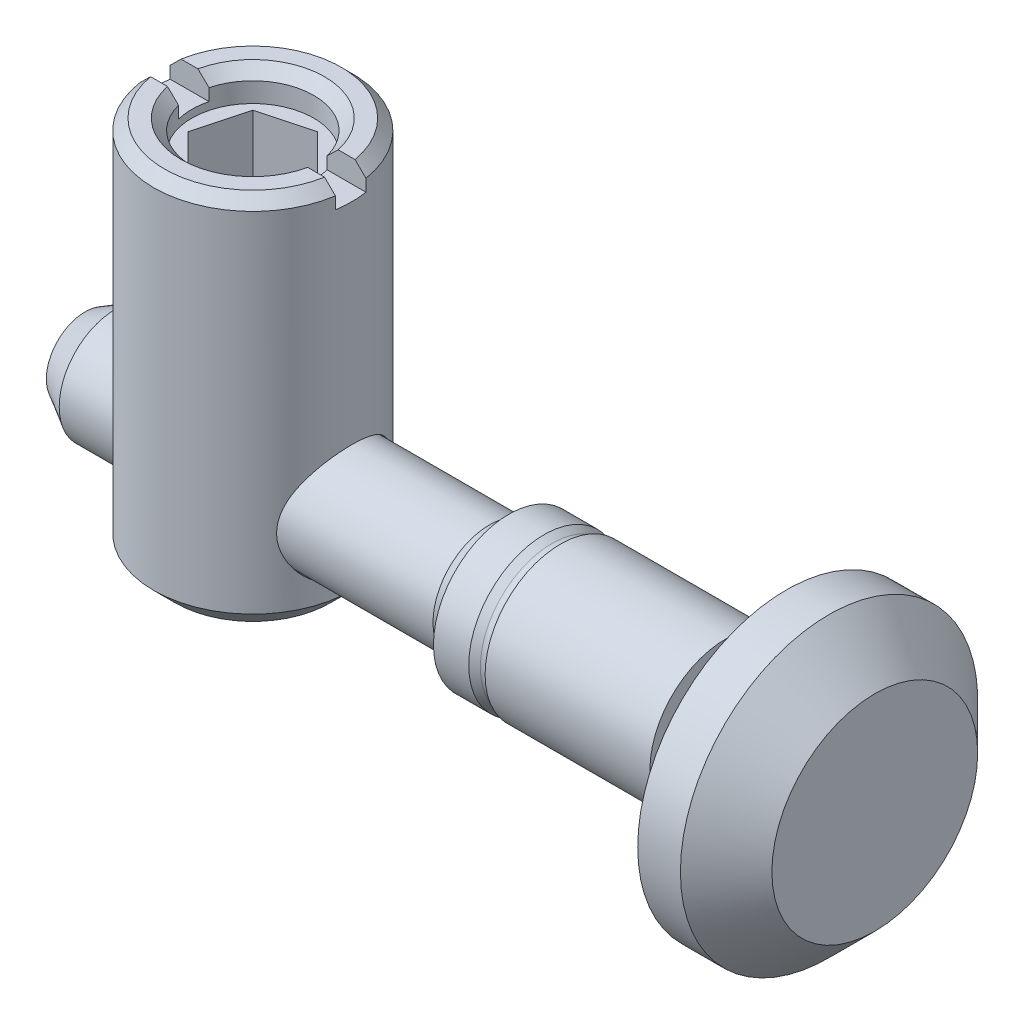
ISO-10303-21;
HEADER;
FILE_DESCRIPTION(('STEP AP214'),'2;1');
FILE_NAME('part.step','',(''),(''),'','','');
FILE_SCHEMA(('AUTOMOTIVE_DESIGN { 1 0 10303 214 1 1 1 1 }'));
ENDSEC;
DATA;
#1=APPLICATION_CONTEXT('core data for automotive mechanical design processes');
#2=APPLICATION_PROTOCOL_DEFINITION('international standard','automotive_design',2000,#1);
#3=PRODUCT_CONTEXT('',#1,'mechanical');
#4=PRODUCT('Part','Part','',(#3));
#5=PRODUCT_RELATED_PRODUCT_CATEGORY('part','',(#4));
#6=PRODUCT_DEFINITION_FORMATION('','',#4);
#7=PRODUCT_DEFINITION_CONTEXT('part definition',#1,'design');
#8=PRODUCT_DEFINITION('design','',#6,#7);
#9=PRODUCT_DEFINITION_SHAPE('','',#8);
#10=(LENGTH_UNIT() NAMED_UNIT(*) SI_UNIT(.MILLI.,.METRE.));
#11=(NAMED_UNIT(*) PLANE_ANGLE_UNIT() SI_UNIT($,.RADIAN.));
#12=(NAMED_UNIT(*) SI_UNIT($,.STERADIAN.) SOLID_ANGLE_UNIT());
#13=UNCERTAINTY_MEASURE_WITH_UNIT(LENGTH_MEASURE(1.E-05),#10,'distance_accuracy_value','');
#14=(GEOMETRIC_REPRESENTATION_CONTEXT(3) GLOBAL_UNCERTAINTY_ASSIGNED_CONTEXT((#13)) GLOBAL_UNIT_ASSIGNED_CONTEXT((#10,
#11,#12)) REPRESENTATION_CONTEXT('',''));
#15=CARTESIAN_POINT('',(0.,0.,0.));
#16=DIRECTION('',(0.,0.,1.));
#17=DIRECTION('',(1.,0.,0.));
#18=AXIS2_PLACEMENT_3D('',#15,#16,#17);
#19=CARTESIAN_POINT('',(0.,0.,0.));
#20=DIRECTION('',(0.,-1.,0.));
#21=DIRECTION('',(0.,0.,1.));
#22=AXIS2_PLACEMENT_3D('',#19,#20,#21);
#23=CONICAL_SURFACE('',#22,5.79289321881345,0.785398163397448);
#24=CARTESIAN_POINT('',(0.,-0.707106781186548,0.));
#25=DIRECTION('',(0.,-1.,0.));
#26=DIRECTION('',(0.,0.,1.));
#27=AXIS2_PLACEMENT_3D('',#24,#25,#26);
#28=CIRCLE('',#27,6.5);
#29=CARTESIAN_POINT('',(6.42261628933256,-0.707106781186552,1.00000000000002));
#30=VERTEX_POINT('',#29);
#31=CARTESIAN_POINT('',(-6.42261628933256,-0.707106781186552,0.999999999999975));
#32=VERTEX_POINT('',#31);
#33=EDGE_CURVE('P0_E277',#30,#32,#28,.T.);
#34=ORIENTED_EDGE('',*,*,#33,.F.);
#35=CARTESIAN_POINT('',(14.2767508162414,-8.51883672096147,1.00000000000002));
#36=CARTESIAN_POINT('',(13.7820154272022,-8.02532023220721,1.00000000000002));
#37=CARTESIAN_POINT('',(13.2872265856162,-7.5318572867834,1.00000000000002));
#38=CARTESIAN_POINT('',(12.2974597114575,-6.54509527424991,1.00000000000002));
#39=CARTESIAN_POINT('',(11.8024816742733,-6.05179621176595,1.00000000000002));
#40=CARTESIAN_POINT('',(10.8119818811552,-5.06514762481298,1.00000000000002));
#41=CARTESIAN_POINT('',(10.3164599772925,-4.57179824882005,1.00000000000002));
#42=CARTESIAN_POINT('',(9.32505246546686,-3.5854903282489,1.00000000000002));
#43=CARTESIAN_POINT('',(8.82916686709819,-3.0925317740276,1.00000000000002));
#44=CARTESIAN_POINT('',(7.83735190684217,-2.10777270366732,1.00000000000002));
#45=CARTESIAN_POINT('',(7.34142321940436,-1.6159715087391,1.00000000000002));
#46=CARTESIAN_POINT('',(6.59669596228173,-0.879073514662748,1.00000000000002));
#47=CARTESIAN_POINT('',(6.34830471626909,-0.633565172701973,1.00000000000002));
#48=CARTESIAN_POINT('',(5.85113575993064,-0.142943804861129,1.00000000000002));
#49=CARTESIAN_POINT('',(5.60235805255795,0.102169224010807,1.00000000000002));
#50=CARTESIAN_POINT('',(5.10433156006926,0.591730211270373,1.00000000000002));
#51=CARTESIAN_POINT('',(4.85508298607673,0.83617838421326,1.00000000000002));
#52=CARTESIAN_POINT('',(4.35570303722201,1.32418609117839,1.00000000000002));
#53=CARTESIAN_POINT('',(4.10557163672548,1.56774559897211,1.00000000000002));
#54=CARTESIAN_POINT('',(3.60391287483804,2.05335933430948,1.00000000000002));
#55=CARTESIAN_POINT('',(3.35238571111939,2.29541376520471,1.00000000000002));
#56=CARTESIAN_POINT('',(2.97308384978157,2.65637206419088,1.00000000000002));
#57=CARTESIAN_POINT('',(2.84631769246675,2.77633483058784,1.00000000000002));
#58=CARTESIAN_POINT('',(2.59180498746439,3.01521496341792,1.00000000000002));
#59=CARTESIAN_POINT('',(2.46405845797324,3.13413234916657,1.00000000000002));
#60=CARTESIAN_POINT('',(2.30054655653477,3.28444174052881,1.00000000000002));
#61=CARTESIAN_POINT('',(2.26546626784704,3.31657913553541,1.00000000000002));
#62=CARTESIAN_POINT('',(2.19517890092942,3.38071517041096,1.00000000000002));
#63=CARTESIAN_POINT('',(2.15997182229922,3.41271380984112,1.00000000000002));
#64=CARTESIAN_POINT('',(2.05413419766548,3.50847607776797,1.00000000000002));
#65=CARTESIAN_POINT('',(1.98328966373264,3.57200384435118,1.00000000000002));
#66=CARTESIAN_POINT('',(1.84074805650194,3.69831454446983,1.00000000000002));
#67=CARTESIAN_POINT('',(1.76904986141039,3.76109621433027,1.00000000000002));
#68=CARTESIAN_POINT('',(1.62465774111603,3.88549597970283,1.00000000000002));
#69=CARTESIAN_POINT('',(1.55196390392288,3.94711417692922,1.00000000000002));
#70=CARTESIAN_POINT('',(1.41643479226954,4.0593775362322,1.00000000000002));
#71=CARTESIAN_POINT('',(1.35379493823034,4.11025782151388,1.00000000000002));
#72=CARTESIAN_POINT('',(1.22718881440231,4.2103368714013,1.00000000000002));
#73=CARTESIAN_POINT('',(1.16322269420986,4.25953582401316,1.00000000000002));
#74=CARTESIAN_POINT('',(1.03350933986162,4.35545414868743,1.00000000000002));
#75=CARTESIAN_POINT('',(0.967763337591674,4.40217517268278,1.00000000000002));
#76=CARTESIAN_POINT('',(0.833777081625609,4.49185572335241,1.00000000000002));
#77=CARTESIAN_POINT('',(0.765538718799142,4.53481802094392,1.00000000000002));
#78=CARTESIAN_POINT('',(0.631417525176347,4.61140607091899,1.00000000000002));
#79=CARTESIAN_POINT('',(0.565814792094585,4.64551212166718,1.00000000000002));
#80=CARTESIAN_POINT('',(0.430973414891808,4.70564086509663,1.00000000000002));
#81=CARTESIAN_POINT('',(0.361742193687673,4.73167936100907,1.00000000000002));
#82=CARTESIAN_POINT('',(0.233183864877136,4.7675411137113,1.00000000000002));
#83=CARTESIAN_POINT('',(0.174481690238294,4.77950814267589,1.00000000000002));
#84=CARTESIAN_POINT('',(0.0559444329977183,4.79304803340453,1.00000000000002));
#85=CARTESIAN_POINT('',(-0.00388794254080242,4.794643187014,1.00000000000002));
#86=CARTESIAN_POINT('',(-0.12279010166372,4.78713542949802,1.00000000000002));
#87=CARTESIAN_POINT('',(-0.181860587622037,4.7780432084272,1.00000000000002));
#88=CARTESIAN_POINT('',(-0.268871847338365,4.75776918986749,1.00000000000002));
#89=CARTESIAN_POINT('',(-0.297650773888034,4.74988882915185,1.00000000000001));
#90=CARTESIAN_POINT('',(-0.354618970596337,4.7322208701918,1.00000000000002));
#91=CARTESIAN_POINT('',(-0.382808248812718,4.72243329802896,1.00000000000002));
#92=CARTESIAN_POINT('',(-0.48326699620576,4.68428164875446,1.00000000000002));
#93=CARTESIAN_POINT('',(-0.553771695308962,4.65128687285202,1.00000000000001));
#94=CARTESIAN_POINT('',(-0.691278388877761,4.57862399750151,1.00000000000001));
#95=CARTESIAN_POINT('',(-0.758271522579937,4.53893999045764,1.00000000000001));
#96=CARTESIAN_POINT('',(-0.890188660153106,4.4550476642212,1.00000000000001));
#97=CARTESIAN_POINT('',(-0.95508840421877,4.41080159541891,1.00000000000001));
#98=CARTESIAN_POINT('',(-1.05090844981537,4.34240511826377,1.00000000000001));
#99=CARTESIAN_POINT('',(-1.08257647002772,4.31928172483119,1.00000000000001));
#100=CARTESIAN_POINT('',(-1.14548808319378,4.27246535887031,1.00000000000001));
#101=CARTESIAN_POINT('',(-1.17673169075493,4.24877240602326,1.00000000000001));
#102=CARTESIAN_POINT('',(-1.27761912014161,4.17106765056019,1.00000000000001));
#103=CARTESIAN_POINT('',(-1.34653509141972,4.11611198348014,1.00000000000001));
#104=CARTESIAN_POINT('',(-1.48307141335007,4.00460981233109,1.00000000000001));
#105=CARTESIAN_POINT('',(-1.55069159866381,3.94806310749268,1.00000000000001));
#106=CARTESIAN_POINT('',(-1.68499584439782,3.8338209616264,1.00000000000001));
#107=CARTESIAN_POINT('',(-1.75167954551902,3.77612509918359,1.00000000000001));
#108=CARTESIAN_POINT('',(-1.88432031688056,3.65990291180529,1.00000000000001));
#109=CARTESIAN_POINT('',(-1.95027736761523,3.60137656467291,1.00000000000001));
#110=CARTESIAN_POINT('',(-2.14751138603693,3.42469673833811,1.));
#111=CARTESIAN_POINT('',(-2.2779538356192,3.30561269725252,1.));
#112=CARTESIAN_POINT('',(-2.5374217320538,3.06597755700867,1.));
#113=CARTESIAN_POINT('',(-2.66644749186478,2.94542679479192,1.));
#114=CARTESIAN_POINT('',(-2.92279147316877,2.70406516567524,0.999999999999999));
#115=CARTESIAN_POINT('',(-3.05011529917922,2.58326024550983,0.999999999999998));
#116=CARTESIAN_POINT('',(-3.30412456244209,2.34096749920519,0.999999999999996));
#117=CARTESIAN_POINT('',(-3.43080996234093,2.21947963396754,0.999999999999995));
#118=CARTESIAN_POINT('',(-3.68360409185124,1.97611821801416,0.999999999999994));
#119=CARTESIAN_POINT('',(-3.80971321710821,1.85424507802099,0.999999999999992));
#120=CARTESIAN_POINT('',(-4.0615764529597,1.61013747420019,0.999999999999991));
#121=CARTESIAN_POINT('',(-4.18733057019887,1.4879030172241,0.999999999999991));
#122=CARTESIAN_POINT('',(-4.52158087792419,1.16229303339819,0.999999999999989));
#123=CARTESIAN_POINT('',(-4.7298406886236,0.958674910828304,0.999999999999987));
#124=CARTESIAN_POINT('',(-5.14586023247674,0.550928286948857,0.999999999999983));
#125=CARTESIAN_POINT('',(-5.35361996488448,0.346799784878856,0.999999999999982));
#126=CARTESIAN_POINT('',(-5.97638111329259,-0.266120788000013,0.999999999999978));
#127=CARTESIAN_POINT('',(-6.39086004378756,-0.67544358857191,0.999999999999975));
#128=CARTESIAN_POINT('',(-7.21921810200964,-1.49501318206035,0.999999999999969));
#129=CARTESIAN_POINT('',(-7.63309693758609,-1.90526026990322,0.999999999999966));
#130=CARTESIAN_POINT('',(-8.46038048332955,-2.72622851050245,0.99999999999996));
#131=CARTESIAN_POINT('',(-8.87378519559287,-3.13694966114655,0.999999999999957));
#132=CARTESIAN_POINT('',(-9.70334638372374,-3.96174456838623,0.999999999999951));
#133=CARTESIAN_POINT('',(-10.1195005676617,-4.37582062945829,0.999999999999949));
#134=CARTESIAN_POINT('',(-10.9515932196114,-5.20419065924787,0.999999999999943));
#135=CARTESIAN_POINT('',(-11.3675316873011,-5.61848462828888,0.99999999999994));
#136=CARTESIAN_POINT('',(-12.1990824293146,-6.44705661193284,0.999999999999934));
#137=CARTESIAN_POINT('',(-12.6146947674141,-6.86133456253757,0.999999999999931));
#138=CARTESIAN_POINT('',(-13.4458016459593,-7.69000725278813,0.999999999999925));
#139=CARTESIAN_POINT('',(-13.8612961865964,-8.10440199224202,0.999999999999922));
#140=CARTESIAN_POINT('',(-14.2767508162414,-8.51883672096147,0.999999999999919));
#141=B_SPLINE_CURVE_WITH_KNOTS('',3,(#35,#36,#37,#38,#39,#40,#41,#42,#43,#44,#45,#46,#47,#48,
#49,#50,#51,#52,#53,#54,#55,#56,#57,#58,#59,#60,#61,#62,#63,#64,#65,#66,#67,#68,#69,#70,#71,#72,
#73,#74,#75,#76,#77,#78,#79,#80,#81,#82,#83,#84,#85,#86,#87,#88,#89,#90,#91,#92,#93,#94,#95,#96,
#97,#98,#99,#100,#101,#102,#103,#104,#105,#106,#107,#108,#109,#110,#111,#112,#113,#114,#115,
#116,#117,#118,#119,#120,#121,#122,#123,#124,#125,#126,#127,#128,#129,#130,#131,#132,#133,#134,
#135,#136,#137,#138,#139,#140),.UNSPECIFIED.,.F.,.F.,(4,2,2,2,2,2,2,2,2,2,2,2,2,2,2,2,2,2,2,2,2,
2,2,2,2,2,2,2,2,2,2,2,2,2,2,2,2,2,2,2,2,2,2,2,2,2,2,2,2,2,2,2,4),(0.,2.09640044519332,
4.19285574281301,6.29057341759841,8.38823761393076,10.483546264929,11.531283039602,
12.5790118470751,13.6263485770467,14.6737159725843,15.7209386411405,16.2445255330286,
16.7681027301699,16.9108292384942,17.0535561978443,17.3390199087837,17.6249128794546,
17.9107807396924,18.1528626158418,18.3949173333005,18.6368086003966,18.8785200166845,
19.1000215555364,19.3210864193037,19.5000485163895,19.6786258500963,19.857024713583,
19.946486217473,20.0359464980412,20.2687920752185,20.5021994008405,20.7377224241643,
20.8553540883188,20.9729816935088,21.2373766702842,21.5018051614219,21.7663324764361,
22.0308668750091,22.5607174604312,23.0904485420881,23.6169869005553,24.1435557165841,
24.6696813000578,25.1957969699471,26.0695759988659,26.9433563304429,28.6909356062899,
30.439187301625,32.1874312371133,33.9486209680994,35.7098133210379,37.4702787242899,
39.2307412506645),.UNSPECIFIED.);
#142=CARTESIAN_POINT('',(5.70592778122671,0.,1.00000000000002));
#143=VERTEX_POINT('',#142);
#144=EDGE_CURVE('P0_E243',#30,#143,#141,.T.);
#145=ORIENTED_EDGE('',*,*,#144,.T.);
#146=CARTESIAN_POINT('',(0.,0.,0.));
#147=DIRECTION('',(0.,-1.,0.));
#148=DIRECTION('',(0.,0.,1.));
#149=AXIS2_PLACEMENT_3D('',#146,#147,#148);
#150=CIRCLE('',#149,5.79289321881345);
#151=CARTESIAN_POINT('',(-5.70592778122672,0.,0.99999999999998));
#152=VERTEX_POINT('',#151);
#153=EDGE_CURVE('P0_E273',#143,#152,#150,.T.);
#154=ORIENTED_EDGE('',*,*,#153,.T.);
#155=EDGE_CURVE('P0_E252',#152,#32,#141,.T.);
#156=ORIENTED_EDGE('',*,*,#155,.T.);
#157=EDGE_LOOP('',(#34,#145,#154,#156));
#158=FACE_BOUND('',#157,.T.);
#159=ADVANCED_FACE('P0_F16',(#158),#23,.T.);
#160=CARTESIAN_POINT('',(-5.79289321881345,0.,0.));
#161=DIRECTION('',(0.,-1.,0.));
#162=DIRECTION('',(0.,0.,1.));
#163=AXIS2_PLACEMENT_3D('',#160,#161,#162);
#164=PLANE('',#163);
#165=ORIENTED_EDGE('',*,*,#153,.F.);
#166=DIRECTION('',(-1.,0.,0.));
#167=VECTOR('',#166,1.);
#168=CARTESIAN_POINT('',(-5.79289321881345,0.,0.99999999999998));
#169=LINE('',#168,#167);
#170=CARTESIAN_POINT('',(4.59965805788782,0.,1.00000000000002));
#171=VERTEX_POINT('',#170);
#172=EDGE_CURVE('P0_E251',#143,#171,#169,.T.);
#173=ORIENTED_EDGE('',*,*,#172,.T.);
#174=CARTESIAN_POINT('',(0.,0.,0.));
#175=DIRECTION('',(0.,-1.,0.));
#176=DIRECTION('',(0.,0.,1.));
#177=AXIS2_PLACEMENT_3D('',#174,#175,#176);
#178=CIRCLE('',#177,4.70710678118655);
#179=CARTESIAN_POINT('',(-4.59965805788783,0.,0.999999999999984));
#180=VERTEX_POINT('',#179);
#181=EDGE_CURVE('P0_E269',#171,#180,#178,.T.);
#182=ORIENTED_EDGE('',*,*,#181,.T.);
#183=EDGE_CURVE('P0_E377',#180,#152,#169,.T.);
#184=ORIENTED_EDGE('',*,*,#183,.T.);
#185=EDGE_LOOP('',(#165,#173,#182,#184));
#186=FACE_BOUND('',#185,.T.);
#187=ADVANCED_FACE('P0_F345',(#186),#164,.F.);
#188=CARTESIAN_POINT('',(0.,-0.707106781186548,0.));
#189=DIRECTION('',(0.,1.,0.));
#190=DIRECTION('',(0.,0.,-1.));
#191=AXIS2_PLACEMENT_3D('',#188,#189,#190);
#192=CONICAL_SURFACE('',#191,4.,0.785398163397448);
#193=ORIENTED_EDGE('',*,*,#181,.F.);
#194=CARTESIAN_POINT('',(10.3234254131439,5.66463908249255,1.00000000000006));
#195=CARTESIAN_POINT('',(10.0050129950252,5.34771766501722,1.00000000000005));
#196=CARTESIAN_POINT('',(9.68653963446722,5.03085742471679,1.00000000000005));
#197=CARTESIAN_POINT('',(9.04937764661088,4.39729076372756,1.00000000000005));
#198=CARTESIAN_POINT('',(8.73068900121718,4.08058436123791,1.00000000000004));
#199=CARTESIAN_POINT('',(8.09223868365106,3.44659800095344,1.00000000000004));
#200=CARTESIAN_POINT('',(7.77247637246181,3.12931868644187,1.00000000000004));
#201=CARTESIAN_POINT('',(7.13262446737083,2.49515223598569,1.00000000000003));
#202=CARTESIAN_POINT('',(6.81253490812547,2.1782650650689,1.00000000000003));
#203=CARTESIAN_POINT('',(6.09139956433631,1.46552011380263,1.00000000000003));
#204=CARTESIAN_POINT('',(5.69020620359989,1.06981142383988,1.00000000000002));
#205=CARTESIAN_POINT('',(5.08721897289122,0.477335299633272,1.00000000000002));
#206=CARTESIAN_POINT('',(4.88599078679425,0.279992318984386,1.00000000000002));
#207=CARTESIAN_POINT('',(4.48299455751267,-0.114128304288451,1.00000000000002));
#208=CARTESIAN_POINT('',(4.28122653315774,-0.310905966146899,1.00000000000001));
#209=CARTESIAN_POINT('',(3.8773186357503,-0.703196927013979,1.00000000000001));
#210=CARTESIAN_POINT('',(3.67518053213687,-0.898712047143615,1.00000000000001));
#211=CARTESIAN_POINT('',(3.26961374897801,-1.28845733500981,1.00000000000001));
#212=CARTESIAN_POINT('',(3.06618490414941,-1.4826873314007,1.00000000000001));
#213=CARTESIAN_POINT('',(2.75945582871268,-1.77223274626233,1.));
#214=CARTESIAN_POINT('',(2.65697906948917,-1.86841974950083,1.));
#215=CARTESIAN_POINT('',(2.45126670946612,-2.05997801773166,1.));
#216=CARTESIAN_POINT('',(2.34803111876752,-2.15534929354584,1.));
#217=CARTESIAN_POINT('',(2.14051224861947,-2.34490236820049,0.999999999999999));
#218=CARTESIAN_POINT('',(2.03622919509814,-2.43908441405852,0.999999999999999));
#219=CARTESIAN_POINT('',(1.82610446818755,-2.62568995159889,0.999999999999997));
#220=CARTESIAN_POINT('',(1.72026292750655,-2.71811359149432,0.999999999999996));
#221=CARTESIAN_POINT('',(1.57007263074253,-2.84575711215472,0.999999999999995));
#222=CARTESIAN_POINT('',(1.52674583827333,-2.88217860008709,0.999999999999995));
#223=CARTESIAN_POINT('',(1.43960187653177,-2.95443538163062,0.999999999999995));
#224=CARTESIAN_POINT('',(1.39578468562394,-2.99027064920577,0.999999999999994));
#225=CARTESIAN_POINT('',(1.30747329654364,-3.06126485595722,0.999999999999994));
#226=CARTESIAN_POINT('',(1.26297801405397,-3.09642244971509,0.999999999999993));
#227=CARTESIAN_POINT('',(1.17324652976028,-3.16577746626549,0.999999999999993));
#228=CARTESIAN_POINT('',(1.12801036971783,-3.19997494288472,0.999999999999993));
#229=CARTESIAN_POINT('',(1.03724961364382,-3.26663779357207,0.999999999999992));
#230=CARTESIAN_POINT('',(0.991737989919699,-3.2991207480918,0.999999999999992));
#231=CARTESIAN_POINT('',(0.899584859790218,-3.36243916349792,0.999999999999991));
#232=CARTESIAN_POINT('',(0.852943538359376,-3.3932748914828,0.999999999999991));
#233=CARTESIAN_POINT('',(0.758353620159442,-3.45261654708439,0.99999999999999));
#234=CARTESIAN_POINT('',(0.71040860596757,-3.48112813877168,0.99999999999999));
#235=CARTESIAN_POINT('',(0.612788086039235,-3.53499253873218,0.99999999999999));
#236=CARTESIAN_POINT('',(0.563113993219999,-3.56034785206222,0.999999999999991));
#237=CARTESIAN_POINT('',(0.480353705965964,-3.59808519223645,0.99999999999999));
#238=CARTESIAN_POINT('',(0.447882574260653,-3.61180984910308,0.999999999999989));
#239=CARTESIAN_POINT('',(0.38207263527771,-3.63703408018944,0.999999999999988));
#240=CARTESIAN_POINT('',(0.348733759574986,-3.64853347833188,0.999999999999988));
#241=CARTESIAN_POINT('',(0.281441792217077,-3.66874871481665,0.999999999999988));
#242=CARTESIAN_POINT('',(0.24749396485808,-3.67748181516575,0.999999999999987));
#243=CARTESIAN_POINT('',(0.178939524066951,-3.69177563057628,0.999999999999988));
#244=CARTESIAN_POINT('',(0.144333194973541,-3.69733768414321,0.999999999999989));
#245=CARTESIAN_POINT('',(0.0741935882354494,-3.70497286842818,0.999999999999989));
#246=CARTESIAN_POINT('',(0.0386542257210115,-3.7069914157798,0.999999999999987));
#247=CARTESIAN_POINT('',(-0.0324339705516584,-3.7072124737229,0.999999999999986));
#248=CARTESIAN_POINT('',(-0.0679828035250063,-3.7054152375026,0.999999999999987));
#249=CARTESIAN_POINT('',(-0.138828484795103,-3.69813403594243,0.999999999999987));
#250=CARTESIAN_POINT('',(-0.174123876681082,-3.6926361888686,0.999999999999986));
#251=CARTESIAN_POINT('',(-0.244042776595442,-3.678329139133,0.999999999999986));
#252=CARTESIAN_POINT('',(-0.278665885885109,-3.66951803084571,0.999999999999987));
#253=CARTESIAN_POINT('',(-0.359615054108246,-3.645348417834,0.999999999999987));
#254=CARTESIAN_POINT('',(-0.405574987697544,-3.62877379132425,0.999999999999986));
#255=CARTESIAN_POINT('',(-0.495860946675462,-3.59167890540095,0.999999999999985));
#256=CARTESIAN_POINT('',(-0.540185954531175,-3.57115623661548,0.999999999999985));
#257=CARTESIAN_POINT('',(-0.627555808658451,-3.52710810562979,0.999999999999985));
#258=CARTESIAN_POINT('',(-0.670593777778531,-3.50356918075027,0.999999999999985));
#259=CARTESIAN_POINT('',(-0.755386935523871,-3.45434208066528,0.999999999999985));
#260=CARTESIAN_POINT('',(-0.797142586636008,-3.42865469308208,0.999999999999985));
#261=CARTESIAN_POINT('',(-0.887000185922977,-3.37092617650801,0.999999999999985));
#262=CARTESIAN_POINT('',(-0.934899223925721,-3.33857110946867,0.999999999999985));
#263=CARTESIAN_POINT('',(-1.02956109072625,-3.27223304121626,0.999999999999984));
#264=CARTESIAN_POINT('',(-1.07632368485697,-3.23824970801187,0.999999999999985));
#265=CARTESIAN_POINT('',(-1.21533894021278,-3.13446265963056,0.999999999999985));
#266=CARTESIAN_POINT('',(-1.30625009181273,-3.06286806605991,0.999999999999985));
#267=CARTESIAN_POINT('',(-1.48600728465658,-2.9167128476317,0.999999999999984));
#268=CARTESIAN_POINT('',(-1.57484741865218,-2.84214507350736,0.999999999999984));
#269=CARTESIAN_POINT('',(-1.75093919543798,-2.691236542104,0.999999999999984));
#270=CARTESIAN_POINT('',(-1.83819149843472,-2.61489655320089,0.999999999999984));
#271=CARTESIAN_POINT('',(-2.01200069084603,-2.4606559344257,0.999999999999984));
#272=CARTESIAN_POINT('',(-2.09855271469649,-2.38274984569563,0.999999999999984));
#273=CARTESIAN_POINT('',(-2.2708746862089,-2.22606094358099,0.999999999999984));
#274=CARTESIAN_POINT('',(-2.35664455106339,-2.14727803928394,0.999999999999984));
#275=CARTESIAN_POINT('',(-2.52745486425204,-1.98920617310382,0.999999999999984));
#276=CARTESIAN_POINT('',(-2.61249627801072,-1.90991825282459,0.999999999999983));
#277=CARTESIAN_POINT('',(-2.78212608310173,-1.75086586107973,0.999999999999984));
#278=CARTESIAN_POINT('',(-2.86671449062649,-1.67110140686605,0.999999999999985));
#279=CARTESIAN_POINT('',(-3.11005923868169,-1.44063384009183,0.999999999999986));
#280=CARTESIAN_POINT('',(-3.26837367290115,-1.28946433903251,0.999999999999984));
#281=CARTESIAN_POINT('',(-3.58419480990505,-0.986283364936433,0.999999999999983));
#282=CARTESIAN_POINT('',(-3.74170150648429,-0.834271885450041,0.999999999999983));
#283=CARTESIAN_POINT('',(-4.21340537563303,-0.377374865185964,0.999999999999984));
#284=CARTESIAN_POINT('',(-4.52677604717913,-0.0716365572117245,0.999999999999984));
#285=CARTESIAN_POINT('',(-5.15260492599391,0.54126922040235,0.999999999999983));
#286=CARTESIAN_POINT('',(-5.46506220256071,0.848437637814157,0.999999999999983));
#287=CARTESIAN_POINT('',(-6.08926138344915,1.46349025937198,0.999999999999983));
#288=CARTESIAN_POINT('',(-6.40100329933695,1.77137445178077,0.999999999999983));
#289=CARTESIAN_POINT('',(-7.01412691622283,2.37780814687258,0.999999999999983));
#290=CARTESIAN_POINT('',(-7.31552289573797,2.67634322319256,0.999999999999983));
#291=CARTESIAN_POINT('',(-7.918019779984,3.27371418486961,0.999999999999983));
#292=CARTESIAN_POINT('',(-8.21912068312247,3.57255007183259,0.999999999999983));
#293=CARTESIAN_POINT('',(-8.82084580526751,4.17017251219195,0.999999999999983));
#294=CARTESIAN_POINT('',(-9.12147021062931,4.46895887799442,0.999999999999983));
#295=CARTESIAN_POINT('',(-9.72255651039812,5.0666914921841,0.999999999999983));
#296=CARTESIAN_POINT('',(-10.0230184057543,5.36563773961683,0.999999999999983));
#297=CARTESIAN_POINT('',(-10.3234254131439,5.66463908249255,0.999999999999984));
#298=B_SPLINE_CURVE_WITH_KNOTS('',3,(#194,#195,#196,#197,#198,#199,#200,#201,#202,#203,#204,
#205,#206,#207,#208,#209,#210,#211,#212,#213,#214,#215,#216,#217,#218,#219,#220,#221,#222,#223,
#224,#225,#226,#227,#228,#229,#230,#231,#232,#233,#234,#235,#236,#237,#238,#239,#240,#241,#242,
#243,#244,#245,#246,#247,#248,#249,#250,#251,#252,#253,#254,#255,#256,#257,#258,#259,#260,#261,
#262,#263,#264,#265,#266,#267,#268,#269,#270,#271,#272,#273,#274,#275,#276,#277,#278,#279,#280,
#281,#282,#283,#284,#285,#286,#287,#288,#289,#290,#291,#292,#293,#294,#295,#296,#297),
.UNSPECIFIED.,.F.,.F.,(4,2,2,2,2,2,2,2,2,2,2,2,2,2,2,2,2,2,2,2,2,2,2,2,2,2,2,2,2,2,2,2,2,2,2,2,
2,2,2,2,2,2,2,2,2,2,2,2,2,2,2,4),(0.,1.3477503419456,2.6956332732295,4.0470126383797,
5.39826126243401,7.08878297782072,7.93431963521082,8.77982717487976,9.62349155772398,
10.4672662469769,10.888904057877,11.3105362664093,11.7320794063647,12.1535868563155,
12.3233876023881,12.4931958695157,12.6633123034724,12.8334191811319,13.001137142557,
13.1688278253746,13.3360967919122,13.5032321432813,13.6089258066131,13.7146278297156,
13.8196566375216,13.9246410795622,14.0312289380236,14.1378097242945,14.244792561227,
14.3518370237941,14.4981492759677,14.6445511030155,14.7916307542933,14.9386567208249,
15.1120174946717,15.285413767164,15.6324549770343,15.9803880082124,16.3281729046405,
16.6775156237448,17.0268949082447,17.3757013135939,17.7244951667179,18.3811790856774,
19.0378680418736,20.3512885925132,21.6657600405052,22.9802100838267,24.252870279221,
25.5255373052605,26.7970854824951,28.068626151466),.UNSPECIFIED.);
#299=CARTESIAN_POINT('',(3.87298334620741,-0.707106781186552,1.00000000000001));
#300=VERTEX_POINT('',#299);
#301=EDGE_CURVE('P0_E371',#171,#300,#298,.T.);
#302=ORIENTED_EDGE('',*,*,#301,.T.);
#303=CARTESIAN_POINT('',(0.,-0.707106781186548,0.));
#304=DIRECTION('',(0.,-1.,0.));
#305=DIRECTION('',(0.,0.,1.));
#306=AXIS2_PLACEMENT_3D('',#303,#304,#305);
#307=CIRCLE('',#306,4.);
#308=CARTESIAN_POINT('',(-3.87298334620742,-0.707106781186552,0.999999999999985));
#309=VERTEX_POINT('',#308);
#310=EDGE_CURVE('P0_E264',#300,#309,#307,.T.);
#311=ORIENTED_EDGE('',*,*,#310,.T.);
#312=EDGE_CURVE('P0_E256',#309,#180,#298,.T.);
#313=ORIENTED_EDGE('',*,*,#312,.T.);
#314=EDGE_LOOP('',(#193,#302,#311,#313));
#315=FACE_BOUND('',#314,.T.);
#316=ADVANCED_FACE('P0_F351',(#315),#192,.F.);
#317=CARTESIAN_POINT('',(0.,-25.,0.));
#318=DIRECTION('',(0.,1.,0.));
#319=DIRECTION('',(0.,0.,-1.));
#320=AXIS2_PLACEMENT_3D('',#317,#318,#319);
#321=PLANE('',#320);
#322=CARTESIAN_POINT('',(0.,-25.,0.));
#323=DIRECTION('',(0.,-1.,0.));
#324=DIRECTION('',(0.,0.,1.));
#325=AXIS2_PLACEMENT_3D('',#322,#323,#324);
#326=CIRCLE('',#325,5.0857864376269);
#327=CARTESIAN_POINT('',(0.,-25.,5.08578643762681));
#328=VERTEX_POINT('',#327);
#329=EDGE_CURVE('P0_E284',#328,#328,#326,.T.);
#330=ORIENTED_EDGE('',*,*,#329,.T.);
#331=EDGE_LOOP('',(#330));
#332=FACE_BOUND('',#331,.T.);
#333=ADVANCED_FACE('P0_F18',(#332),#321,.F.);
#334=CARTESIAN_POINT('',(0.,-23.5857864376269,0.));
#335=DIRECTION('',(0.,1.,0.));
#336=DIRECTION('',(0.,0.,-1.));
#337=AXIS2_PLACEMENT_3D('',#334,#335,#336);
#338=CONICAL_SURFACE('',#337,6.49999999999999,0.785398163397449);
#339=ORIENTED_EDGE('',*,*,#329,.F.);
#340=EDGE_LOOP('',(#339));
#341=FACE_BOUND('',#340,.T.);
#342=CARTESIAN_POINT('',(0.,-23.5857864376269,0.));
#343=DIRECTION('',(0.,-1.,0.));
#344=DIRECTION('',(0.,0.,1.));
#345=AXIS2_PLACEMENT_3D('',#342,#343,#344);
#346=CIRCLE('',#345,6.49999999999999);
#347=CARTESIAN_POINT('',(0.,-23.5857864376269,6.49999999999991));
#348=VERTEX_POINT('',#347);
#349=EDGE_CURVE('P0_E281',#348,#348,#346,.T.);
#350=ORIENTED_EDGE('',*,*,#349,.T.);
#351=EDGE_LOOP('',(#350));
#352=FACE_BOUND('',#351,.T.);
#353=ADVANCED_FACE('P0_F505',(#341,#352),#338,.T.);
#354=CARTESIAN_POINT('',(0.,-2.,0.));
#355=DIRECTION('',(0.,-1.,0.));
#356=DIRECTION('',(0.,0.,1.));
#357=AXIS2_PLACEMENT_3D('',#354,#355,#356);
#358=CYLINDRICAL_SURFACE('',#357,6.49999999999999);
#359=ORIENTED_EDGE('',*,*,#33,.T.);
#360=DIRECTION('',(0.,-1.,0.));
#361=VECTOR('',#360,1.);
#362=CARTESIAN_POINT('',(-6.42261628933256,-2.00000000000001,0.999999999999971));
#363=LINE('',#362,#361);
#364=CARTESIAN_POINT('',(-6.42261628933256,-1.5,0.999999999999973));
#365=VERTEX_POINT('',#364);
#366=EDGE_CURVE('P0_E257',#32,#365,#363,.T.);
#367=ORIENTED_EDGE('',*,*,#366,.T.);
#368=CARTESIAN_POINT('',(0.,-1.5,0.));
#369=DIRECTION('',(0.,1.,0.));
#370=DIRECTION('',(0.,0.,-1.));
#371=AXIS2_PLACEMENT_3D('',#368,#369,#370);
#372=CIRCLE('',#371,6.49999999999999);
#373=CARTESIAN_POINT('',(-6.42261628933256,-1.5,-1.00000000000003));
#374=VERTEX_POINT('',#373);
#375=EDGE_CURVE('P0_E189',#374,#365,#372,.T.);
#376=ORIENTED_EDGE('',*,*,#375,.F.);
#377=DIRECTION('',(0.,-1.,0.));
#378=VECTOR('',#377,1.);
#379=CARTESIAN_POINT('',(-6.42261628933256,-2.,-1.00000000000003));
#380=LINE('',#379,#378);
#381=CARTESIAN_POINT('',(-6.42261628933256,-0.707106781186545,-1.00000000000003));
#382=VERTEX_POINT('',#381);
#383=EDGE_CURVE('P0_E230',#374,#382,#380,.F.);
#384=ORIENTED_EDGE('',*,*,#383,.T.);
#385=CARTESIAN_POINT('',(6.42261628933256,-0.707106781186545,-0.999999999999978));
#386=VERTEX_POINT('',#385);
#387=EDGE_CURVE('P0_E280',#382,#386,#28,.T.);
#388=ORIENTED_EDGE('',*,*,#387,.T.);
#389=DIRECTION('',(0.,-1.,0.));
#390=VECTOR('',#389,1.);
#391=CARTESIAN_POINT('',(6.42261628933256,-2.,-0.999999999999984));
#392=LINE('',#391,#390);
#393=CARTESIAN_POINT('',(6.42261628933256,-1.5,-0.999999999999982));
#394=VERTEX_POINT('',#393);
#395=EDGE_CURVE('P0_E376',#386,#394,#392,.T.);
#396=ORIENTED_EDGE('',*,*,#395,.T.);
#397=CARTESIAN_POINT('',(6.42261628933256,-1.5,1.00000000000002));
#398=VERTEX_POINT('',#397);
#399=EDGE_CURVE('P0_E192',#398,#394,#372,.T.);
#400=ORIENTED_EDGE('',*,*,#399,.F.);
#401=DIRECTION('',(0.,-1.,0.));
#402=VECTOR('',#401,1.);
#403=CARTESIAN_POINT('',(6.42261628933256,-2.00000000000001,1.00000000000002));
#404=LINE('',#403,#402);
#405=EDGE_CURVE('P0_E250',#398,#30,#404,.F.);
#406=ORIENTED_EDGE('',*,*,#405,.T.);
#407=EDGE_LOOP('',(#359,#367,#376,#384,#388,#396,#400,#406));
#408=FACE_BOUND('',#407,.T.);
#409=CARTESIAN_POINT('',(6.49999999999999,-22.8,0.));
#410=CARTESIAN_POINT('',(6.49999922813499,-22.7999991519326,0.0965889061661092));
#411=CARTESIAN_POINT('',(6.49784138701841,-22.7962623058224,0.193203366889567));
#412=CARTESIAN_POINT('',(6.48926230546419,-22.781361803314,0.385707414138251));
#413=CARTESIAN_POINT('',(6.48283854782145,-22.7701937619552,0.481596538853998));
#414=CARTESIAN_POINT('',(6.46587087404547,-22.7405468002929,0.672060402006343));
#415=CARTESIAN_POINT('',(6.45531920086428,-22.7220541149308,0.766632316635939));
#416=CARTESIAN_POINT('',(6.43036163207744,-22.6779986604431,0.953608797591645));
#417=CARTESIAN_POINT('',(6.41595409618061,-22.652432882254,1.0460124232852));
#418=CARTESIAN_POINT('',(6.36760175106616,-22.5658469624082,1.31808089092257));
#419=CARTESIAN_POINT('',(6.32842056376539,-22.4947582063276,1.4937326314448));
#420=CARTESIAN_POINT('',(6.23949649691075,-22.3285251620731,1.83003942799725));
#421=CARTESIAN_POINT('',(6.18975620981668,-22.2333867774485,1.99069815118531));
#422=CARTESIAN_POINT('',(6.07970694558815,-22.0139519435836,2.3058595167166));
#423=CARTESIAN_POINT('',(6.01889129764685,-21.8880329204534,2.45905462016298));
#424=CARTESIAN_POINT('',(5.89472568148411,-21.6142137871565,2.74341889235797));
#425=CARTESIAN_POINT('',(5.83137276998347,-21.4662875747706,2.87456150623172));
#426=CARTESIAN_POINT('',(5.70097489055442,-21.1331915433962,3.12586961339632));
#427=CARTESIAN_POINT('',(5.63430375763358,-20.9457089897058,3.24318893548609));
#428=CARTESIAN_POINT('',(5.51376416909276,-20.5497908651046,3.44415592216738));
#429=CARTESIAN_POINT('',(5.45987610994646,-20.3413880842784,3.52785528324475));
#430=CARTESIAN_POINT('',(5.38369511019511,-19.9575474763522,3.64272763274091));
#431=CARTESIAN_POINT('',(5.35702043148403,-19.7852505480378,3.68148363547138));
#432=CARTESIAN_POINT('',(5.32031627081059,-19.4352490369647,3.73434274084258));
#433=CARTESIAN_POINT('',(5.31026842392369,-19.2575506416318,3.74847304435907));
#434=CARTESIAN_POINT('',(5.30827656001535,-18.9015903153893,3.7512937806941));
#435=CARTESIAN_POINT('',(5.31635913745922,-18.7233279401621,3.73994684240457));
#436=CARTESIAN_POINT('',(5.34947024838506,-18.3717259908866,3.69242044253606));
#437=CARTESIAN_POINT('',(5.37451065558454,-18.1983899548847,3.65622358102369));
#438=CARTESIAN_POINT('',(5.43801154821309,-17.8618462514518,3.56107260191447));
#439=CARTESIAN_POINT('',(5.47639842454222,-17.6985886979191,3.5022431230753));
#440=CARTESIAN_POINT('',(5.56244972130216,-17.3837684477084,3.36389346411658));
#441=CARTESIAN_POINT('',(5.61011766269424,-17.2322102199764,3.28436542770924));
#442=CARTESIAN_POINT('',(5.71877142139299,-16.918837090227,3.09188256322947));
#443=CARTESIAN_POINT('',(5.78066134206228,-16.7593809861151,2.97559140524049));
#444=CARTESIAN_POINT('',(5.90537722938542,-16.4607114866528,2.71971391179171));
#445=CARTESIAN_POINT('',(5.96820396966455,-16.3215159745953,2.58010722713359));
#446=CARTESIAN_POINT('',(6.0965493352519,-16.0506175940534,2.26159332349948));
#447=CARTESIAN_POINT('',(6.16150488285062,-15.9217566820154,2.07998946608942));
#448=CARTESIAN_POINT('',(6.24933140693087,-15.7531968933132,1.79055918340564));
#449=CARTESIAN_POINT('',(6.2770149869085,-15.7011162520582,1.69120158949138));
#450=CARTESIAN_POINT('',(6.32840316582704,-15.6057573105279,1.48738822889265));
#451=CARTESIAN_POINT('',(6.35211018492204,-15.5624736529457,1.38293561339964));
#452=CARTESIAN_POINT('',(6.39336752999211,-15.4879017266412,1.17691806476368));
#453=CARTESIAN_POINT('',(6.41122605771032,-15.4559996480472,1.07563656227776));
#454=CARTESIAN_POINT('',(6.44233599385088,-15.4007926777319,0.870113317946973));
#455=CARTESIAN_POINT('',(6.45558990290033,-15.3774831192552,0.76587321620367));
#456=CARTESIAN_POINT('',(6.47709694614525,-15.3398080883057,0.555342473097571));
#457=CARTESIAN_POINT('',(6.48535307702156,-15.3254372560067,0.449053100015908));
#458=CARTESIAN_POINT('',(6.49661812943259,-15.3058562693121,0.235361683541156));
#459=CARTESIAN_POINT('',(6.49962766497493,-15.3006450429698,0.127959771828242));
#460=CARTESIAN_POINT('',(6.50026519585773,-15.299540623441,-0.0735321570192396));
#461=CARTESIAN_POINT('',(6.49851596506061,-15.3025691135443,-0.167616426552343));
#462=CARTESIAN_POINT('',(6.4909684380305,-15.3156727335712,-0.355159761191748));
#463=CARTESIAN_POINT('',(6.48516887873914,-15.3257500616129,-0.448618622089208));
#464=CARTESIAN_POINT('',(6.46965970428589,-15.352822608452,-0.634163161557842));
#465=CARTESIAN_POINT('',(6.45995162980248,-15.369815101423,-0.726249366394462));
#466=CARTESIAN_POINT('',(6.43685779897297,-15.4105063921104,-0.908469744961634));
#467=CARTESIAN_POINT('',(6.42347062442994,-15.4342077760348,-0.998603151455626));
#468=CARTESIAN_POINT('',(6.37861575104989,-15.5142941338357,-1.26285022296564));
#469=CARTESIAN_POINT('',(6.34222508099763,-15.5800492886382,-1.4333980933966));
#470=CARTESIAN_POINT('',(6.25918887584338,-15.734257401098,-1.76102929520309));
#471=CARTESIAN_POINT('',(6.21254096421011,-15.8227156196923,-1.91810949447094));
#472=CARTESIAN_POINT('',(6.10719219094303,-16.0302124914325,-2.23212390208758));
#473=CARTESIAN_POINT('',(6.04774179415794,-16.1514777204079,-2.38733590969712));
#474=CARTESIAN_POINT('',(5.92550059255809,-16.4160243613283,-2.6764044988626));
#475=CARTESIAN_POINT('',(5.86270598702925,-16.5593311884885,-2.81023605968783));
#476=CARTESIAN_POINT('',(5.73215083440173,-16.8833117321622,-3.06849991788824));
#477=CARTESIAN_POINT('',(5.66465189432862,-17.066388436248,-3.19007192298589));
#478=CARTESIAN_POINT('',(5.54090173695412,-17.4538863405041,-3.40049464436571));
#479=CARTESIAN_POINT('',(5.48463607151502,-17.6582796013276,-3.48938751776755));
#480=CARTESIAN_POINT('',(5.4023030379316,-18.0380898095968,-3.61517928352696));
#481=CARTESIAN_POINT('',(5.37234708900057,-18.2103195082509,-3.65914054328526));
#482=CARTESIAN_POINT('',(5.32881354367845,-18.5612079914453,-3.72226589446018));
#483=CARTESIAN_POINT('',(5.31521651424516,-18.7398588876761,-3.74145940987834));
#484=CARTESIAN_POINT('',(5.30637562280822,-19.0989522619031,-3.75399124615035));
#485=CARTESIAN_POINT('',(5.31117417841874,-19.2793979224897,-3.74726981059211));
#486=CARTESIAN_POINT('',(5.33848066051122,-19.636168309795,-3.7082551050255));
#487=CARTESIAN_POINT('',(5.36099965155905,-19.8124903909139,-3.67594585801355));
#488=CARTESIAN_POINT('',(5.41990405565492,-20.15242120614,-3.58849624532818));
#489=CARTESIAN_POINT('',(5.45596271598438,-20.3162277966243,-3.53389141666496));
#490=CARTESIAN_POINT('',(5.53796255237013,-20.6327005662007,-3.40394738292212));
#491=CARTESIAN_POINT('',(5.58390730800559,-20.7853626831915,-3.32860066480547));
#492=CARTESIAN_POINT('',(5.68912996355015,-21.1003779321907,-3.1458762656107));
#493=CARTESIAN_POINT('',(5.74937105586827,-21.2605814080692,-3.03534768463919));
#494=CARTESIAN_POINT('',(5.87173904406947,-21.5617273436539,-2.79129801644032));
#495=CARTESIAN_POINT('',(5.93386758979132,-21.7026523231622,-2.65775630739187));
#496=CARTESIAN_POINT('',(6.06267457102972,-21.9801119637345,-2.35057574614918));
#497=CARTESIAN_POINT('',(6.12887318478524,-22.1136190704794,-2.17397177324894));
#498=CARTESIAN_POINT('',(6.24975110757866,-22.3487970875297,-1.79713143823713));
#499=CARTESIAN_POINT('',(6.30443690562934,-22.4504859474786,-1.59690848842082));
#500=CARTESIAN_POINT('',(6.38781523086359,-22.6024576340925,-1.21524665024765));
#501=CARTESIAN_POINT('',(6.41940395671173,-22.6586736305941,-1.03682471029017));
#502=CARTESIAN_POINT('',(6.45567949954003,-22.7226810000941,-0.763344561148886));
#503=CARTESIAN_POINT('',(6.46591620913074,-22.7406242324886,-0.671288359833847));
#504=CARTESIAN_POINT('',(6.48249039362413,-22.7695872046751,-0.485762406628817));
#505=CARTESIAN_POINT('',(6.48882996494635,-22.7806106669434,-0.392293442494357));
#506=CARTESIAN_POINT('',(6.49542435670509,-22.792064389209,-0.248867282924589));
#507=CARTESIAN_POINT('',(6.49713874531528,-22.795038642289,-0.199162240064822));
#508=CARTESIAN_POINT('',(6.49942683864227,-22.7990067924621,-0.0996404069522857));
#509=CARTESIAN_POINT('',(6.5000003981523,-22.8000004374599,-0.0498236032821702));
#510=CARTESIAN_POINT('',(6.49999999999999,-22.8,0.));
#511=B_SPLINE_CURVE_WITH_KNOTS('',3,(#409,#410,#411,#412,#413,#414,#415,#416,#417,#418,#419,
#420,#421,#422,#423,#424,#425,#426,#427,#428,#429,#430,#431,#432,#433,#434,#435,#436,#437,#438,
#439,#440,#441,#442,#443,#444,#445,#446,#447,#448,#449,#450,#451,#452,#453,#454,#455,#456,#457,
#458,#459,#460,#461,#462,#463,#464,#465,#466,#467,#468,#469,#470,#471,#472,#473,#474,#475,#476,
#477,#478,#479,#480,#481,#482,#483,#484,#485,#486,#487,#488,#489,#490,#491,#492,#493,#494,#495,
#496,#497,#498,#499,#500,#501,#502,#503,#504,#505,#506,#507,#508,#509,#510),.UNSPECIFIED.,.T.,
.F.,(4,2,2,2,2,2,2,2,2,2,2,2,2,2,2,2,2,2,2,2,2,2,2,2,2,2,2,2,2,2,2,2,2,2,2,2,2,2,2,2,2,2,2,2,2,
2,2,2,2,2,4),(0.,0.28971478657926,0.579600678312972,0.870033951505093,1.16059097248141,
1.73830346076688,2.31587427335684,2.9356466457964,3.55616006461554,4.24573452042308,
4.93424453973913,5.46775354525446,6.00067287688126,6.53437442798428,7.06845005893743,
7.59962566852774,8.13100318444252,8.74904794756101,9.3676349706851,10.0595163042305,
10.4057357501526,10.7517437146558,11.0743210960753,11.3967230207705,11.7189314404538,
12.0411021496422,12.3232028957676,12.6053916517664,12.8874692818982,13.1696557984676,
13.7262451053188,14.2829635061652,14.8977168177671,15.513184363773,16.1995753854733,
16.8850778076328,17.4235576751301,17.96139723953,18.50047773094,19.0398950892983,
19.5670538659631,20.0944038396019,20.7032692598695,21.3126831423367,22.0024305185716,
22.691788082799,23.258221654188,23.54097206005,23.8235702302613,23.9729952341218,
24.1224392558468),.UNSPECIFIED.);
#512=CARTESIAN_POINT('',(6.49999999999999,-22.8,0.));
#513=VERTEX_POINT('',#512);
#514=EDGE_CURVE('P0_E265',#513,#513,#511,.T.);
#515=ORIENTED_EDGE('',*,*,#514,.T.);
#516=EDGE_LOOP('',(#515));
#517=FACE_BOUND('',#516,.T.);
#518=CARTESIAN_POINT('',(-6.49999999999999,-22.8,-1.02348685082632E-13));
#519=CARTESIAN_POINT('',(-6.49999922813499,-22.7999991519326,-0.0965889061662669));
#520=CARTESIAN_POINT('',(-6.49784138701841,-22.7962623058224,-0.193203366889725));
#521=CARTESIAN_POINT('',(-6.48926230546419,-22.781361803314,-0.385707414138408));
#522=CARTESIAN_POINT('',(-6.48283854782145,-22.7701937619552,-0.481596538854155));
#523=CARTESIAN_POINT('',(-6.46587087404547,-22.7405468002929,-0.6720604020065));
#524=CARTESIAN_POINT('',(-6.45531920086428,-22.7220541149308,-0.766632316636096));
#525=CARTESIAN_POINT('',(-6.43036163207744,-22.6779986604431,-0.953608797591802));
#526=CARTESIAN_POINT('',(-6.41595409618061,-22.652432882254,-1.04601242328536));
#527=CARTESIAN_POINT('',(-6.36760175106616,-22.5658469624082,-1.31808089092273));
#528=CARTESIAN_POINT('',(-6.32842056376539,-22.4947582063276,-1.49373263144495));
#529=CARTESIAN_POINT('',(-6.23949649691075,-22.3285251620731,-1.83003942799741));
#530=CARTESIAN_POINT('',(-6.18975620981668,-22.2333867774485,-1.99069815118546));
#531=CARTESIAN_POINT('',(-6.07970694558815,-22.0139519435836,-2.30585951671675));
#532=CARTESIAN_POINT('',(-6.01889129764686,-21.8880329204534,-2.45905462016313));
#533=CARTESIAN_POINT('',(-5.89472568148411,-21.6142137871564,-2.74341889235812));
#534=CARTESIAN_POINT('',(-5.83137276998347,-21.4662875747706,-2.87456150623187));
#535=CARTESIAN_POINT('',(-5.70097489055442,-21.1331915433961,-3.12586961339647));
#536=CARTESIAN_POINT('',(-5.63430375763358,-20.9457089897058,-3.24318893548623));
#537=CARTESIAN_POINT('',(-5.51376416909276,-20.5497908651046,-3.44415592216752));
#538=CARTESIAN_POINT('',(-5.45987610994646,-20.3413880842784,-3.52785528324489));
#539=CARTESIAN_POINT('',(-5.38369511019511,-19.9575474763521,-3.64272763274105));
#540=CARTESIAN_POINT('',(-5.35702043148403,-19.7852505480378,-3.68148363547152));
#541=CARTESIAN_POINT('',(-5.32031627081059,-19.4352490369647,-3.73434274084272));
#542=CARTESIAN_POINT('',(-5.31026842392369,-19.2575506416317,-3.74847304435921));
#543=CARTESIAN_POINT('',(-5.30827656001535,-18.9015903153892,-3.75129378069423));
#544=CARTESIAN_POINT('',(-5.31635913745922,-18.7233279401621,-3.7399468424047));
#545=CARTESIAN_POINT('',(-5.34947024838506,-18.3717259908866,-3.69242044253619));
#546=CARTESIAN_POINT('',(-5.37451065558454,-18.1983899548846,-3.65622358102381));
#547=CARTESIAN_POINT('',(-5.43801154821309,-17.8618462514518,-3.56107260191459));
#548=CARTESIAN_POINT('',(-5.47639842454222,-17.6985886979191,-3.50224312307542));
#549=CARTESIAN_POINT('',(-5.56244972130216,-17.3837684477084,-3.36389346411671));
#550=CARTESIAN_POINT('',(-5.61011766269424,-17.2322102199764,-3.28436542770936));
#551=CARTESIAN_POINT('',(-5.71877142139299,-16.918837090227,-3.09188256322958));
#552=CARTESIAN_POINT('',(-5.78066134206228,-16.7593809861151,-2.97559140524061));
#553=CARTESIAN_POINT('',(-5.90537722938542,-16.4607114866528,-2.71971391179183));
#554=CARTESIAN_POINT('',(-5.96820396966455,-16.3215159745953,-2.5801072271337));
#555=CARTESIAN_POINT('',(-6.0965493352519,-16.0506175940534,-2.2615933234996));
#556=CARTESIAN_POINT('',(-6.16150488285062,-15.9217566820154,-2.07998946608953));
#557=CARTESIAN_POINT('',(-6.24933140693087,-15.7531968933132,-1.79055918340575));
#558=CARTESIAN_POINT('',(-6.2770149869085,-15.7011162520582,-1.69120158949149));
#559=CARTESIAN_POINT('',(-6.32840316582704,-15.6057573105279,-1.48738822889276));
#560=CARTESIAN_POINT('',(-6.35211018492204,-15.5624736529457,-1.38293561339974));
#561=CARTESIAN_POINT('',(-6.39336752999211,-15.4879017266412,-1.17691806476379));
#562=CARTESIAN_POINT('',(-6.41122605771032,-15.4559996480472,-1.07563656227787));
#563=CARTESIAN_POINT('',(-6.44233599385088,-15.4007926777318,-0.870113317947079));
#564=CARTESIAN_POINT('',(-6.45558990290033,-15.3774831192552,-0.765873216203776));
#565=CARTESIAN_POINT('',(-6.47709694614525,-15.3398080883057,-0.555342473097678));
#566=CARTESIAN_POINT('',(-6.48535307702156,-15.3254372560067,-0.449053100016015));
#567=CARTESIAN_POINT('',(-6.49661812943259,-15.3058562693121,-0.235361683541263));
#568=CARTESIAN_POINT('',(-6.49962766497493,-15.3006450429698,-0.127959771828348));
#569=CARTESIAN_POINT('',(-6.50026519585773,-15.299540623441,0.0735321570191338));
#570=CARTESIAN_POINT('',(-6.49851596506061,-15.3025691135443,0.167616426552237));
#571=CARTESIAN_POINT('',(-6.4909684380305,-15.3156727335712,0.355159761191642));
#572=CARTESIAN_POINT('',(-6.48516887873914,-15.3257500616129,0.448618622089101));
#573=CARTESIAN_POINT('',(-6.46965970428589,-15.352822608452,0.634163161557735));
#574=CARTESIAN_POINT('',(-6.45995162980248,-15.369815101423,0.726249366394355));
#575=CARTESIAN_POINT('',(-6.43685779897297,-15.4105063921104,0.908469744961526));
#576=CARTESIAN_POINT('',(-6.42347062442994,-15.4342077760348,0.998603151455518));
#577=CARTESIAN_POINT('',(-6.37861575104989,-15.5142941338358,1.26285022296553));
#578=CARTESIAN_POINT('',(-6.34222508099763,-15.5800492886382,1.4333980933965));
#579=CARTESIAN_POINT('',(-6.25918887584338,-15.734257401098,1.76102929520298));
#580=CARTESIAN_POINT('',(-6.21254096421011,-15.8227156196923,1.91810949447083));
#581=CARTESIAN_POINT('',(-6.10719219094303,-16.0302124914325,2.23212390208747));
#582=CARTESIAN_POINT('',(-6.04774179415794,-16.1514777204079,2.38733590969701));
#583=CARTESIAN_POINT('',(-5.92550059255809,-16.4160243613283,2.67640449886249));
#584=CARTESIAN_POINT('',(-5.86270598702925,-16.5593311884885,2.81023605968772));
#585=CARTESIAN_POINT('',(-5.73215083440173,-16.8833117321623,3.06849991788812));
#586=CARTESIAN_POINT('',(-5.66465189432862,-17.066388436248,3.19007192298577));
#587=CARTESIAN_POINT('',(-5.54090173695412,-17.4538863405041,3.40049464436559));
#588=CARTESIAN_POINT('',(-5.48463607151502,-17.6582796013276,3.48938751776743));
#589=CARTESIAN_POINT('',(-5.4023030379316,-18.0380898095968,3.61517928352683));
#590=CARTESIAN_POINT('',(-5.37234708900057,-18.2103195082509,3.65914054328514));
#591=CARTESIAN_POINT('',(-5.32881354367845,-18.5612079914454,3.72226589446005));
#592=CARTESIAN_POINT('',(-5.31521651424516,-18.7398588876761,3.74145940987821));
#593=CARTESIAN_POINT('',(-5.30637562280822,-19.0989522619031,3.75399124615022));
#594=CARTESIAN_POINT('',(-5.31117417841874,-19.2793979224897,3.74726981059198));
#595=CARTESIAN_POINT('',(-5.33848066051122,-19.636168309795,3.70825510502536));
#596=CARTESIAN_POINT('',(-5.36099965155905,-19.8124903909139,3.67594585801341));
#597=CARTESIAN_POINT('',(-5.41990405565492,-20.15242120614,3.58849624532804));
#598=CARTESIAN_POINT('',(-5.45596271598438,-20.3162277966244,3.53389141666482));
#599=CARTESIAN_POINT('',(-5.53796255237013,-20.6327005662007,3.40394738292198));
#600=CARTESIAN_POINT('',(-5.58390730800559,-20.7853626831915,3.32860066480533));
#601=CARTESIAN_POINT('',(-5.68912996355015,-21.1003779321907,3.14587626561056));
#602=CARTESIAN_POINT('',(-5.74937105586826,-21.2605814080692,3.03534768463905));
#603=CARTESIAN_POINT('',(-5.87173904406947,-21.561727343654,2.79129801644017));
#604=CARTESIAN_POINT('',(-5.93386758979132,-21.7026523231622,2.65775630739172));
#605=CARTESIAN_POINT('',(-6.06267457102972,-21.9801119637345,2.35057574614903));
#606=CARTESIAN_POINT('',(-6.12887318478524,-22.1136190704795,2.17397177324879));
#607=CARTESIAN_POINT('',(-6.24975110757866,-22.3487970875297,1.79713143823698));
#608=CARTESIAN_POINT('',(-6.30443690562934,-22.4504859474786,1.59690848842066));
#609=CARTESIAN_POINT('',(-6.38781523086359,-22.6024576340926,1.2152466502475));
#610=CARTESIAN_POINT('',(-6.41940395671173,-22.6586736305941,1.03682471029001));
#611=CARTESIAN_POINT('',(-6.45567949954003,-22.7226810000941,0.763344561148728));
#612=CARTESIAN_POINT('',(-6.46591620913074,-22.7406242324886,0.67128835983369));
#613=CARTESIAN_POINT('',(-6.48249039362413,-22.7695872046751,0.485762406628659));
#614=CARTESIAN_POINT('',(-6.48882996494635,-22.7806106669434,0.392293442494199));
#615=CARTESIAN_POINT('',(-6.49542435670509,-22.792064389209,0.248867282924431));
#616=CARTESIAN_POINT('',(-6.49713874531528,-22.795038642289,0.199162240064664));
#617=CARTESIAN_POINT('',(-6.49942683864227,-22.7990067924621,0.0996404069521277));
#618=CARTESIAN_POINT('',(-6.5000003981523,-22.8000004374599,0.0498236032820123));
#619=CARTESIAN_POINT('',(-6.49999999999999,-22.8,-1.02348685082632E-13));
#620=B_SPLINE_CURVE_WITH_KNOTS('',3,(#518,#519,#520,#521,#522,#523,#524,#525,#526,#527,#528,
#529,#530,#531,#532,#533,#534,#535,#536,#537,#538,#539,#540,#541,#542,#543,#544,#545,#546,#547,
#548,#549,#550,#551,#552,#553,#554,#555,#556,#557,#558,#559,#560,#561,#562,#563,#564,#565,#566,
#567,#568,#569,#570,#571,#572,#573,#574,#575,#576,#577,#578,#579,#580,#581,#582,#583,#584,#585,
#586,#587,#588,#589,#590,#591,#592,#593,#594,#595,#596,#597,#598,#599,#600,#601,#602,#603,#604,
#605,#606,#607,#608,#609,#610,#611,#612,#613,#614,#615,#616,#617,#618,#619),.UNSPECIFIED.,.T.,
.F.,(4,2,2,2,2,2,2,2,2,2,2,2,2,2,2,2,2,2,2,2,2,2,2,2,2,2,2,2,2,2,2,2,2,2,2,2,2,2,2,2,2,2,2,2,2,
2,2,2,2,2,4),(0.,0.289714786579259,0.579600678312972,0.870033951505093,1.16059097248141,
1.73830346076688,2.31587427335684,2.9356466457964,3.55616006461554,4.24573452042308,
4.93424453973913,5.46775354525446,6.00067287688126,6.53437442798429,7.06845005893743,
7.59962566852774,8.13100318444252,8.749047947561,9.36763497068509,10.0595163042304,
10.4057357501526,10.7517437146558,11.0743210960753,11.3967230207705,11.7189314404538,
12.0411021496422,12.3232028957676,12.6053916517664,12.8874692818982,13.1696557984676,
13.7262451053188,14.2829635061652,14.8977168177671,15.513184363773,16.1995753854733,
16.8850778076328,17.4235576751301,17.96139723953,18.50047773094,19.0398950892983,
19.5670538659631,20.0944038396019,20.7032692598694,21.3126831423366,22.0024305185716,
22.691788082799,23.258221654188,23.54097206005,23.8235702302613,23.9729952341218,
24.1224392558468),.UNSPECIFIED.);
#621=CARTESIAN_POINT('',(-6.49999999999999,-22.8,-1.02348685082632E-13));
#622=VERTEX_POINT('',#621);
#623=EDGE_CURVE('P0_E260',#622,#622,#620,.T.);
#624=ORIENTED_EDGE('',*,*,#623,.T.);
#625=EDGE_LOOP('',(#624));
#626=FACE_BOUND('',#625,.T.);
#627=ORIENTED_EDGE('',*,*,#349,.F.);
#628=EDGE_LOOP('',(#627));
#629=FACE_BOUND('',#628,.T.);
#630=ADVANCED_FACE('P0_F238',(#408,#517,#626,#629),#358,.T.);
#631=ORIENTED_EDGE('',*,*,#387,.F.);
#632=CARTESIAN_POINT('',(-14.2767508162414,-8.51883672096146,-1.00000000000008));
#633=CARTESIAN_POINT('',(-13.7820154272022,-8.02532023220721,-1.00000000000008));
#634=CARTESIAN_POINT('',(-13.2872265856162,-7.53185728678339,-1.00000000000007));
#635=CARTESIAN_POINT('',(-12.2974597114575,-6.5450952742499,-1.00000000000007));
#636=CARTESIAN_POINT('',(-11.8024816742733,-6.05179621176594,-1.00000000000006));
#637=CARTESIAN_POINT('',(-10.8119818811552,-5.06514762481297,-1.00000000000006));
#638=CARTESIAN_POINT('',(-10.3164599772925,-4.57179824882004,-1.00000000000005));
#639=CARTESIAN_POINT('',(-9.32505246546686,-3.58549032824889,-1.00000000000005));
#640=CARTESIAN_POINT('',(-8.82916686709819,-3.09253177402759,-1.00000000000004));
#641=CARTESIAN_POINT('',(-7.83735190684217,-2.10777270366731,-1.00000000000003));
#642=CARTESIAN_POINT('',(-7.34142321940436,-1.61597150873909,-1.00000000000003));
#643=CARTESIAN_POINT('',(-6.59669596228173,-0.879073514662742,-1.00000000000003));
#644=CARTESIAN_POINT('',(-6.34830471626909,-0.633565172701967,-1.00000000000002));
#645=CARTESIAN_POINT('',(-5.85113575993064,-0.142943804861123,-1.00000000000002));
#646=CARTESIAN_POINT('',(-5.60235805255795,0.102169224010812,-1.00000000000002));
#647=CARTESIAN_POINT('',(-5.10433156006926,0.591730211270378,-1.00000000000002));
#648=CARTESIAN_POINT('',(-4.85508298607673,0.836178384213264,-1.00000000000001));
#649=CARTESIAN_POINT('',(-4.35570303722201,1.3241860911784,-1.00000000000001));
#650=CARTESIAN_POINT('',(-4.10557163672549,1.56774559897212,-1.00000000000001));
#651=CARTESIAN_POINT('',(-3.60391287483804,2.05335933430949,-1.00000000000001));
#652=CARTESIAN_POINT('',(-3.3523857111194,2.29541376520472,-1.));
#653=CARTESIAN_POINT('',(-2.97308384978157,2.65637206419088,-1.));
#654=CARTESIAN_POINT('',(-2.84631769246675,2.77633483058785,-1.));
#655=CARTESIAN_POINT('',(-2.59180498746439,3.01521496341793,-0.999999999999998));
#656=CARTESIAN_POINT('',(-2.46405845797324,3.13413234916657,-0.999999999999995));
#657=CARTESIAN_POINT('',(-2.30054655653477,3.28444174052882,-0.999999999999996));
#658=CARTESIAN_POINT('',(-2.26546626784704,3.31657913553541,-0.999999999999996));
#659=CARTESIAN_POINT('',(-2.19517890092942,3.38071517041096,-0.999999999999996));
#660=CARTESIAN_POINT('',(-2.15997182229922,3.41271380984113,-0.999999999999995));
#661=CARTESIAN_POINT('',(-2.05413419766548,3.50847607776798,-0.999999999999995));
#662=CARTESIAN_POINT('',(-1.98328966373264,3.57200384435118,-0.999999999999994));
#663=CARTESIAN_POINT('',(-1.84074805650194,3.69831454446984,-0.999999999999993));
#664=CARTESIAN_POINT('',(-1.76904986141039,3.76109621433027,-0.999999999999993));
#665=CARTESIAN_POINT('',(-1.62465774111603,3.88549597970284,-0.999999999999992));
#666=CARTESIAN_POINT('',(-1.55196390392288,3.94711417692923,-0.999999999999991));
#667=CARTESIAN_POINT('',(-1.41643479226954,4.05937753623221,-0.99999999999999));
#668=CARTESIAN_POINT('',(-1.35379493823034,4.11025782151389,-0.99999999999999));
#669=CARTESIAN_POINT('',(-1.22718881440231,4.21033687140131,-0.99999999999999));
#670=CARTESIAN_POINT('',(-1.16322269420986,4.25953582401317,-0.999999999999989));
#671=CARTESIAN_POINT('',(-1.03350933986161,4.35545414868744,-0.999999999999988));
#672=CARTESIAN_POINT('',(-0.967763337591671,4.40217517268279,-0.999999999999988));
#673=CARTESIAN_POINT('',(-0.833777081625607,4.49185572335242,-0.999999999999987));
#674=CARTESIAN_POINT('',(-0.765538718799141,4.53481802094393,-0.999999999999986));
#675=CARTESIAN_POINT('',(-0.631417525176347,4.611406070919,-0.999999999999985));
#676=CARTESIAN_POINT('',(-0.565814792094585,4.64551212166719,-0.999999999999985));
#677=CARTESIAN_POINT('',(-0.430973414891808,4.70564086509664,-0.999999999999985));
#678=CARTESIAN_POINT('',(-0.361742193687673,4.73167936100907,-0.999999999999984));
#679=CARTESIAN_POINT('',(-0.233183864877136,4.76754111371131,-0.999999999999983));
#680=CARTESIAN_POINT('',(-0.174481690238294,4.7795081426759,-0.999999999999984));
#681=CARTESIAN_POINT('',(-0.0559444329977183,4.79304803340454,-0.999999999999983));
#682=CARTESIAN_POINT('',(0.00388794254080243,4.794643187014,-0.999999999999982));
#683=CARTESIAN_POINT('',(0.12279010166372,4.78713542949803,-0.999999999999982));
#684=CARTESIAN_POINT('',(0.181860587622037,4.7780432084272,-0.999999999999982));
#685=CARTESIAN_POINT('',(0.268871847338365,4.7577691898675,-0.999999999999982));
#686=CARTESIAN_POINT('',(0.297650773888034,4.74988882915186,-0.999999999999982));
#687=CARTESIAN_POINT('',(0.354618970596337,4.73222087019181,-0.999999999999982));
#688=CARTESIAN_POINT('',(0.382808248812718,4.72243329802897,-0.999999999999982));
#689=CARTESIAN_POINT('',(0.48326699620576,4.68428164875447,-0.999999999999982));
#690=CARTESIAN_POINT('',(0.553771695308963,4.65128687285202,-0.999999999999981));
#691=CARTESIAN_POINT('',(0.691278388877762,4.57862399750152,-0.999999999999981));
#692=CARTESIAN_POINT('',(0.758271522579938,4.53893999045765,-0.999999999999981));
#693=CARTESIAN_POINT('',(0.890188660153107,4.45504766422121,-0.999999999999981));
#694=CARTESIAN_POINT('',(0.95508840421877,4.41080159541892,-0.999999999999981));
#695=CARTESIAN_POINT('',(1.05090844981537,4.34240511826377,-0.999999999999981));
#696=CARTESIAN_POINT('',(1.08257647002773,4.3192817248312,-0.999999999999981));
#697=CARTESIAN_POINT('',(1.14548808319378,4.27246535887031,-0.99999999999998));
#698=CARTESIAN_POINT('',(1.17673169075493,4.24877240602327,-0.99999999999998));
#699=CARTESIAN_POINT('',(1.27761912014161,4.1710676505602,-0.99999999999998));
#700=CARTESIAN_POINT('',(1.34653509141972,4.11611198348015,-0.99999999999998));
#701=CARTESIAN_POINT('',(1.48307141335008,4.00460981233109,-0.999999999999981));
#702=CARTESIAN_POINT('',(1.55069159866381,3.94806310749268,-0.99999999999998));
#703=CARTESIAN_POINT('',(1.68499584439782,3.83382096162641,-0.99999999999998));
#704=CARTESIAN_POINT('',(1.75167954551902,3.7761250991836,-0.99999999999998));
#705=CARTESIAN_POINT('',(1.88432031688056,3.6599029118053,-0.99999999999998));
#706=CARTESIAN_POINT('',(1.95027736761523,3.60137656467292,-0.99999999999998));
#707=CARTESIAN_POINT('',(2.14751138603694,3.42469673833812,-0.99999999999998));
#708=CARTESIAN_POINT('',(2.27795383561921,3.30561269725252,-0.99999999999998));
#709=CARTESIAN_POINT('',(2.53742173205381,3.06597755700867,-0.99999999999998));
#710=CARTESIAN_POINT('',(2.66644749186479,2.94542679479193,-0.99999999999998));
#711=CARTESIAN_POINT('',(2.92279147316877,2.70406516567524,-0.99999999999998));
#712=CARTESIAN_POINT('',(3.05011529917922,2.58326024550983,-0.99999999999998));
#713=CARTESIAN_POINT('',(3.30412456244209,2.34096749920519,-0.99999999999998));
#714=CARTESIAN_POINT('',(3.43080996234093,2.21947963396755,-0.99999999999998));
#715=CARTESIAN_POINT('',(3.68360409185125,1.97611821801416,-0.99999999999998));
#716=CARTESIAN_POINT('',(3.80971321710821,1.854245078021,-0.999999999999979));
#717=CARTESIAN_POINT('',(4.0615764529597,1.6101374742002,-0.99999999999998));
#718=CARTESIAN_POINT('',(4.18733057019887,1.48790301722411,-0.99999999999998));
#719=CARTESIAN_POINT('',(4.52158087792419,1.16229303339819,-0.99999999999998));
#720=CARTESIAN_POINT('',(4.7298406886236,0.958674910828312,-0.99999999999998));
#721=CARTESIAN_POINT('',(5.14586023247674,0.550928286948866,-0.999999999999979));
#722=CARTESIAN_POINT('',(5.35361996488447,0.346799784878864,-0.999999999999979));
#723=CARTESIAN_POINT('',(5.97638111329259,-0.266120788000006,-0.999999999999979));
#724=CARTESIAN_POINT('',(6.39086004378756,-0.675443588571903,-0.999999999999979));
#725=CARTESIAN_POINT('',(7.21921810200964,-1.49501318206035,-0.999999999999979));
#726=CARTESIAN_POINT('',(7.6330969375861,-1.90526026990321,-0.999999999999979));
#727=CARTESIAN_POINT('',(8.46038048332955,-2.72622851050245,-0.999999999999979));
#728=CARTESIAN_POINT('',(8.87378519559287,-3.13694966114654,-0.999999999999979));
#729=CARTESIAN_POINT('',(9.70334638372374,-3.96174456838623,-0.999999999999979));
#730=CARTESIAN_POINT('',(10.1195005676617,-4.37582062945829,-0.999999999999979));
#731=CARTESIAN_POINT('',(10.9515932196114,-5.20419065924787,-0.999999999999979));
#732=CARTESIAN_POINT('',(11.3675316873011,-5.61848462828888,-0.999999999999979));
#733=CARTESIAN_POINT('',(12.1990824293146,-6.44705661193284,-0.999999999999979));
#734=CARTESIAN_POINT('',(12.6146947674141,-6.86133456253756,-0.999999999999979));
#735=CARTESIAN_POINT('',(13.4458016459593,-7.69000725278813,-0.999999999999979));
#736=CARTESIAN_POINT('',(13.8612961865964,-8.10440199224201,-0.999999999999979));
#737=CARTESIAN_POINT('',(14.2767508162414,-8.51883672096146,-0.999999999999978));
#738=B_SPLINE_CURVE_WITH_KNOTS('',3,(#632,#633,#634,#635,#636,#637,#638,#639,#640,#641,#642,
#643,#644,#645,#646,#647,#648,#649,#650,#651,#652,#653,#654,#655,#656,#657,#658,#659,#660,#661,
#662,#663,#664,#665,#666,#667,#668,#669,#670,#671,#672,#673,#674,#675,#676,#677,#678,#679,#680,
#681,#682,#683,#684,#685,#686,#687,#688,#689,#690,#691,#692,#693,#694,#695,#696,#697,#698,#699,
#700,#701,#702,#703,#704,#705,#706,#707,#708,#709,#710,#711,#712,#713,#714,#715,#716,#717,#718,
#719,#720,#721,#722,#723,#724,#725,#726,#727,#728,#729,#730,#731,#732,#733,#734,#735,#736,#737),
.UNSPECIFIED.,.F.,.F.,(4,2,2,2,2,2,2,2,2,2,2,2,2,2,2,2,2,2,2,2,2,2,2,2,2,2,2,2,2,2,2,2,2,2,2,2,
2,2,2,2,2,2,2,2,2,2,2,2,2,2,2,2,4),(0.,2.09640044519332,4.19285574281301,6.2905734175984,
8.38823761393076,10.483546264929,11.531283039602,12.5790118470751,13.6263485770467,
14.6737159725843,15.7209386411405,16.2445255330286,16.7681027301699,16.9108292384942,
17.0535561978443,17.3390199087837,17.6249128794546,17.9107807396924,18.1528626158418,
18.3949173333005,18.6368086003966,18.8785200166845,19.1000215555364,19.3210864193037,
19.5000485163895,19.6786258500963,19.857024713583,19.946486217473,20.0359464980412,
20.2687920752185,20.5021994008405,20.7377224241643,20.8553540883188,20.9729816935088,
21.2373766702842,21.5018051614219,21.7663324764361,22.0308668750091,22.5607174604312,
23.0904485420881,23.6169869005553,24.1435557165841,24.6696813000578,25.1957969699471,
26.0695759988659,26.9433563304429,28.6909356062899,30.439187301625,32.1874312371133,
33.9486209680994,35.7098133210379,37.4702787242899,39.2307412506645),.UNSPECIFIED.);
#739=CARTESIAN_POINT('',(-5.70592778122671,0.,-1.00000000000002));
#740=VERTEX_POINT('',#739);
#741=EDGE_CURVE('P0_E223',#382,#740,#738,.T.);
#742=ORIENTED_EDGE('',*,*,#741,.T.);
#743=CARTESIAN_POINT('',(5.70592778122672,0.,-0.999999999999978));
#744=VERTEX_POINT('',#743);
#745=EDGE_CURVE('P0_E276',#740,#744,#150,.T.);
#746=ORIENTED_EDGE('',*,*,#745,.T.);
#747=EDGE_CURVE('P0_E231',#744,#386,#738,.T.);
#748=ORIENTED_EDGE('',*,*,#747,.T.);
#749=EDGE_LOOP('',(#631,#742,#746,#748));
#750=FACE_BOUND('',#749,.T.);
#751=ADVANCED_FACE('P0_F233',(#750),#23,.T.);
#752=ORIENTED_EDGE('',*,*,#745,.F.);
#753=DIRECTION('',(1.,0.,0.));
#754=VECTOR('',#753,1.);
#755=CARTESIAN_POINT('',(-5.79289321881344,0.,-1.00000000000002));
#756=LINE('',#755,#754);
#757=CARTESIAN_POINT('',(-4.59965805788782,0.,-1.00000000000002));
#758=VERTEX_POINT('',#757);
#759=EDGE_CURVE('P0_E200',#740,#758,#756,.T.);
#760=ORIENTED_EDGE('',*,*,#759,.T.);
#761=CARTESIAN_POINT('',(4.59965805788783,0.,-0.999999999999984));
#762=VERTEX_POINT('',#761);
#763=EDGE_CURVE('P0_E272',#758,#762,#178,.T.);
#764=ORIENTED_EDGE('',*,*,#763,.T.);
#765=EDGE_CURVE('P0_E397',#762,#744,#756,.T.);
#766=ORIENTED_EDGE('',*,*,#765,.T.);
#767=EDGE_LOOP('',(#752,#760,#764,#766));
#768=FACE_BOUND('',#767,.T.);
#769=ADVANCED_FACE('P0_F237',(#768),#164,.F.);
#770=ORIENTED_EDGE('',*,*,#763,.F.);
#771=CARTESIAN_POINT('',(-10.3234254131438,5.66463908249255,-1.00000000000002));
#772=CARTESIAN_POINT('',(-10.0050129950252,5.34771766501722,-1.00000000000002));
#773=CARTESIAN_POINT('',(-9.68653963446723,5.0308574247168,-1.00000000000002));
#774=CARTESIAN_POINT('',(-9.04937764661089,4.39729076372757,-1.00000000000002));
#775=CARTESIAN_POINT('',(-8.7306890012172,4.08058436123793,-1.00000000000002));
#776=CARTESIAN_POINT('',(-8.09223868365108,3.44659800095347,-1.00000000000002));
#777=CARTESIAN_POINT('',(-7.77247637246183,3.1293186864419,-1.00000000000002));
#778=CARTESIAN_POINT('',(-7.13262446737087,2.49515223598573,-1.00000000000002));
#779=CARTESIAN_POINT('',(-6.81253490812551,2.17826506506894,-1.00000000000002));
#780=CARTESIAN_POINT('',(-6.09139956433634,1.46552011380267,-1.00000000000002));
#781=CARTESIAN_POINT('',(-5.69020620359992,1.06981142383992,-1.00000000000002));
#782=CARTESIAN_POINT('',(-5.08721897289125,0.477335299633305,-1.00000000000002));
#783=CARTESIAN_POINT('',(-4.88599078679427,0.279992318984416,-1.00000000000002));
#784=CARTESIAN_POINT('',(-4.48299455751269,-0.114128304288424,-1.00000000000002));
#785=CARTESIAN_POINT('',(-4.28122653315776,-0.310905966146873,-1.00000000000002));
#786=CARTESIAN_POINT('',(-3.87731863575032,-0.703196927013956,-1.00000000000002));
#787=CARTESIAN_POINT('',(-3.67518053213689,-0.898712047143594,-1.00000000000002));
#788=CARTESIAN_POINT('',(-3.26961374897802,-1.2884573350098,-1.00000000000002));
#789=CARTESIAN_POINT('',(-3.06618490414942,-1.48268733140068,-1.00000000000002));
#790=CARTESIAN_POINT('',(-2.75945582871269,-1.77223274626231,-1.00000000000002));
#791=CARTESIAN_POINT('',(-2.65697906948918,-1.86841974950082,-1.00000000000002));
#792=CARTESIAN_POINT('',(-2.45126670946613,-2.05997801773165,-1.00000000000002));
#793=CARTESIAN_POINT('',(-2.34803111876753,-2.15534929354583,-1.00000000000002));
#794=CARTESIAN_POINT('',(-2.14051224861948,-2.34490236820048,-1.00000000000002));
#795=CARTESIAN_POINT('',(-2.03622919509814,-2.43908441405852,-1.00000000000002));
#796=CARTESIAN_POINT('',(-1.82610446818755,-2.62568995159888,-1.00000000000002));
#797=CARTESIAN_POINT('',(-1.72026292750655,-2.71811359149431,-1.00000000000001));
#798=CARTESIAN_POINT('',(-1.57007263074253,-2.84575711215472,-1.00000000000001));
#799=CARTESIAN_POINT('',(-1.52674583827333,-2.88217860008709,-1.00000000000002));
#800=CARTESIAN_POINT('',(-1.43960187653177,-2.95443538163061,-1.00000000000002));
#801=CARTESIAN_POINT('',(-1.39578468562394,-2.99027064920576,-1.00000000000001));
#802=CARTESIAN_POINT('',(-1.30747329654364,-3.06126485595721,-1.00000000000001));
#803=CARTESIAN_POINT('',(-1.26297801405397,-3.09642244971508,-1.00000000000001));
#804=CARTESIAN_POINT('',(-1.17324652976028,-3.16577746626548,-1.00000000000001));
#805=CARTESIAN_POINT('',(-1.12801036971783,-3.19997494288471,-1.00000000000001));
#806=CARTESIAN_POINT('',(-1.03724961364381,-3.26663779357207,-1.00000000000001));
#807=CARTESIAN_POINT('',(-0.991737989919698,-3.29912074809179,-1.00000000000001));
#808=CARTESIAN_POINT('',(-0.899584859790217,-3.36243916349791,-1.00000000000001));
#809=CARTESIAN_POINT('',(-0.852943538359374,-3.3932748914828,-1.00000000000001));
#810=CARTESIAN_POINT('',(-0.758353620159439,-3.45261654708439,-1.00000000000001));
#811=CARTESIAN_POINT('',(-0.710408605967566,-3.48112813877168,-1.00000000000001));
#812=CARTESIAN_POINT('',(-0.612788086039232,-3.53499253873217,-1.00000000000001));
#813=CARTESIAN_POINT('',(-0.563113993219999,-3.56034785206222,-1.00000000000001));
#814=CARTESIAN_POINT('',(-0.480353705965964,-3.59808519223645,-1.00000000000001));
#815=CARTESIAN_POINT('',(-0.447882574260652,-3.61180984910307,-1.00000000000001));
#816=CARTESIAN_POINT('',(-0.382072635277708,-3.63703408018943,-1.00000000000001));
#817=CARTESIAN_POINT('',(-0.348733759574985,-3.64853347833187,-1.00000000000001));
#818=CARTESIAN_POINT('',(-0.281441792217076,-3.66874871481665,-1.00000000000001));
#819=CARTESIAN_POINT('',(-0.247493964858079,-3.67748181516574,-1.00000000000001));
#820=CARTESIAN_POINT('',(-0.178939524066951,-3.69177563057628,-1.00000000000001));
#821=CARTESIAN_POINT('',(-0.144333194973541,-3.6973376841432,-1.00000000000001));
#822=CARTESIAN_POINT('',(-0.074193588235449,-3.70497286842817,-1.00000000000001));
#823=CARTESIAN_POINT('',(-0.0386542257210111,-3.70699141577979,-1.00000000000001));
#824=CARTESIAN_POINT('',(0.0324339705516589,-3.70721247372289,-1.00000000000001));
#825=CARTESIAN_POINT('',(0.0679828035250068,-3.7054152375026,-1.00000000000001));
#826=CARTESIAN_POINT('',(0.138828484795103,-3.69813403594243,-1.00000000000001));
#827=CARTESIAN_POINT('',(0.174123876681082,-3.69263618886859,-1.00000000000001));
#828=CARTESIAN_POINT('',(0.244042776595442,-3.67832913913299,-1.00000000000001));
#829=CARTESIAN_POINT('',(0.278665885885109,-3.66951803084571,-1.00000000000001));
#830=CARTESIAN_POINT('',(0.359615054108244,-3.64534841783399,-1.00000000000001));
#831=CARTESIAN_POINT('',(0.405574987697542,-3.62877379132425,-1.00000000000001));
#832=CARTESIAN_POINT('',(0.495860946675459,-3.59167890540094,-1.00000000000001));
#833=CARTESIAN_POINT('',(0.540185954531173,-3.57115623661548,-1.00000000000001));
#834=CARTESIAN_POINT('',(0.627555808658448,-3.52710810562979,-1.00000000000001));
#835=CARTESIAN_POINT('',(0.670593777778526,-3.50356918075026,-1.00000000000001));
#836=CARTESIAN_POINT('',(0.755386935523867,-3.45434208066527,-1.00000000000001));
#837=CARTESIAN_POINT('',(0.797142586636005,-3.42865469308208,-1.00000000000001));
#838=CARTESIAN_POINT('',(0.887000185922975,-3.37092617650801,-1.00000000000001));
#839=CARTESIAN_POINT('',(0.934899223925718,-3.33857110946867,-1.00000000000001));
#840=CARTESIAN_POINT('',(1.02956109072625,-3.27223304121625,-1.00000000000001));
#841=CARTESIAN_POINT('',(1.07632368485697,-3.23824970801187,-1.00000000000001));
#842=CARTESIAN_POINT('',(1.21533894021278,-3.13446265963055,-1.00000000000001));
#843=CARTESIAN_POINT('',(1.30625009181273,-3.0628680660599,-1.00000000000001));
#844=CARTESIAN_POINT('',(1.48600728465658,-2.9167128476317,-1.));
#845=CARTESIAN_POINT('',(1.57484741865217,-2.84214507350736,-1.));
#846=CARTESIAN_POINT('',(1.75093919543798,-2.691236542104,-1.));
#847=CARTESIAN_POINT('',(1.83819149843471,-2.61489655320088,-1.));
#848=CARTESIAN_POINT('',(2.01200069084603,-2.4606559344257,-1.));
#849=CARTESIAN_POINT('',(2.09855271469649,-2.38274984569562,-1.));
#850=CARTESIAN_POINT('',(2.27087468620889,-2.22606094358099,-0.999999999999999));
#851=CARTESIAN_POINT('',(2.35664455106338,-2.14727803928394,-0.999999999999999));
#852=CARTESIAN_POINT('',(2.52745486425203,-1.98920617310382,-0.999999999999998));
#853=CARTESIAN_POINT('',(2.61249627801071,-1.90991825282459,-0.999999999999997));
#854=CARTESIAN_POINT('',(2.78212608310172,-1.75086586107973,-0.999999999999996));
#855=CARTESIAN_POINT('',(2.86671449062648,-1.67110140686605,-0.999999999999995));
#856=CARTESIAN_POINT('',(3.11005923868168,-1.44063384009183,-0.999999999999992));
#857=CARTESIAN_POINT('',(3.26837367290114,-1.28946433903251,-0.999999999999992));
#858=CARTESIAN_POINT('',(3.58419480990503,-0.986283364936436,-0.999999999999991));
#859=CARTESIAN_POINT('',(3.74170150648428,-0.834271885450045,-0.99999999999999));
#860=CARTESIAN_POINT('',(4.21340537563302,-0.377374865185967,-0.999999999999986));
#861=CARTESIAN_POINT('',(4.52677604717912,-0.0716365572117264,-0.999999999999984));
#862=CARTESIAN_POINT('',(5.1526049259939,0.541269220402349,-0.999999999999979));
#863=CARTESIAN_POINT('',(5.4650622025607,0.848437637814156,-0.999999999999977));
#864=CARTESIAN_POINT('',(6.08926138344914,1.46349025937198,-0.999999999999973));
#865=CARTESIAN_POINT('',(6.40100329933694,1.77137445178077,-0.999999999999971));
#866=CARTESIAN_POINT('',(7.01412691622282,2.37780814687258,-0.999999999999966));
#867=CARTESIAN_POINT('',(7.31552289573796,2.67634322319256,-0.999999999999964));
#868=CARTESIAN_POINT('',(7.91801977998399,3.27371418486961,-0.99999999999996));
#869=CARTESIAN_POINT('',(8.21912068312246,3.57255007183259,-0.999999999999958));
#870=CARTESIAN_POINT('',(8.82084580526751,4.17017251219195,-0.999999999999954));
#871=CARTESIAN_POINT('',(9.1214702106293,4.46895887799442,-0.999999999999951));
#872=CARTESIAN_POINT('',(9.72255651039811,5.0666914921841,-0.999999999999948));
#873=CARTESIAN_POINT('',(10.0230184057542,5.36563773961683,-0.999999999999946));
#874=CARTESIAN_POINT('',(10.3234254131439,5.66463908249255,-0.999999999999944));
#875=B_SPLINE_CURVE_WITH_KNOTS('',3,(#771,#772,#773,#774,#775,#776,#777,#778,#779,#780,#781,
#782,#783,#784,#785,#786,#787,#788,#789,#790,#791,#792,#793,#794,#795,#796,#797,#798,#799,#800,
#801,#802,#803,#804,#805,#806,#807,#808,#809,#810,#811,#812,#813,#814,#815,#816,#817,#818,#819,
#820,#821,#822,#823,#824,#825,#826,#827,#828,#829,#830,#831,#832,#833,#834,#835,#836,#837,#838,
#839,#840,#841,#842,#843,#844,#845,#846,#847,#848,#849,#850,#851,#852,#853,#854,#855,#856,#857,
#858,#859,#860,#861,#862,#863,#864,#865,#866,#867,#868,#869,#870,#871,#872,#873,#874),
.UNSPECIFIED.,.F.,.F.,(4,2,2,2,2,2,2,2,2,2,2,2,2,2,2,2,2,2,2,2,2,2,2,2,2,2,2,2,2,2,2,2,2,2,2,2,
2,2,2,2,2,2,2,2,2,2,2,2,2,2,2,4),(0.,1.34775034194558,2.69563327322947,4.04701263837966,
5.39826126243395,7.08878297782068,7.93431963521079,8.77982717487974,9.62349155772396,
10.4672662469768,10.888904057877,11.3105362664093,11.7320794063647,12.1535868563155,
12.3233876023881,12.4931958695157,12.6633123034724,12.8334191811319,13.001137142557,
13.1688278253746,13.3360967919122,13.5032321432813,13.6089258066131,13.7146278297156,
13.8196566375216,13.9246410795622,14.0312289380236,14.1378097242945,14.244792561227,
14.3518370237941,14.4981492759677,14.6445511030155,14.7916307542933,14.9386567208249,
15.1120174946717,15.285413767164,15.6324549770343,15.9803880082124,16.3281729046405,
16.6775156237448,17.0268949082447,17.3757013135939,17.7244951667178,18.3811790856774,
19.0378680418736,20.3512885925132,21.6657600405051,22.9802100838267,24.252870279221,
25.5255373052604,26.7970854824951,28.0686261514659),.UNSPECIFIED.);
#876=CARTESIAN_POINT('',(-3.87298334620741,-0.707106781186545,-1.00000000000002));
#877=VERTEX_POINT('',#876);
#878=EDGE_CURVE('P0_E191',#758,#877,#875,.T.);
#879=ORIENTED_EDGE('',*,*,#878,.T.);
#880=CARTESIAN_POINT('',(3.87298334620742,-0.707106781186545,-0.999999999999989));
#881=VERTEX_POINT('',#880);
#882=EDGE_CURVE('P0_E268',#877,#881,#307,.T.);
#883=ORIENTED_EDGE('',*,*,#882,.T.);
#884=EDGE_CURVE('P0_E201',#881,#762,#875,.T.);
#885=ORIENTED_EDGE('',*,*,#884,.T.);
#886=EDGE_LOOP('',(#770,#879,#883,#885));
#887=FACE_BOUND('',#886,.T.);
#888=ADVANCED_FACE('P0_F203',(#887),#192,.F.);
#889=CARTESIAN_POINT('',(0.,-2.,0.));
#890=DIRECTION('',(0.,-1.,0.));
#891=DIRECTION('',(0.,0.,1.));
#892=AXIS2_PLACEMENT_3D('',#889,#890,#891);
#893=CYLINDRICAL_SURFACE('',#892,4.);
#894=ORIENTED_EDGE('',*,*,#310,.F.);
#895=DIRECTION('',(0.,-1.,0.));
#896=VECTOR('',#895,1.);
#897=CARTESIAN_POINT('',(3.87298334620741,-2.00000000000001,1.00000000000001));
#898=LINE('',#897,#896);
#899=CARTESIAN_POINT('',(3.87298334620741,-1.5,1.00000000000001));
#900=VERTEX_POINT('',#899);
#901=EDGE_CURVE('P0_E307',#300,#900,#898,.T.);
#902=ORIENTED_EDGE('',*,*,#901,.T.);
#903=CARTESIAN_POINT('',(0.,-1.5,0.));
#904=DIRECTION('',(0.,1.,0.));
#905=DIRECTION('',(0.,0.,-1.));
#906=AXIS2_PLACEMENT_3D('',#903,#904,#905);
#907=CIRCLE('',#906,4.);
#908=CARTESIAN_POINT('',(3.87298334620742,-1.5,-0.99999999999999));
#909=VERTEX_POINT('',#908);
#910=EDGE_CURVE('P0_E298',#909,#900,#907,.F.);
#911=ORIENTED_EDGE('',*,*,#910,.F.);
#912=DIRECTION('',(0.,-1.,0.));
#913=VECTOR('',#912,1.);
#914=CARTESIAN_POINT('',(3.87298334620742,-2.,-0.999999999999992));
#915=LINE('',#914,#913);
#916=EDGE_CURVE('P0_E304',#909,#881,#915,.F.);
#917=ORIENTED_EDGE('',*,*,#916,.T.);
#918=ORIENTED_EDGE('',*,*,#882,.F.);
#919=DIRECTION('',(0.,-1.,0.));
#920=VECTOR('',#919,1.);
#921=CARTESIAN_POINT('',(-3.87298334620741,-2.,-1.00000000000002));
#922=LINE('',#921,#920);
#923=CARTESIAN_POINT('',(-3.87298334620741,-1.5,-1.00000000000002));
#924=VERTEX_POINT('',#923);
#925=EDGE_CURVE('P0_E297',#877,#924,#922,.T.);
#926=ORIENTED_EDGE('',*,*,#925,.T.);
#927=CARTESIAN_POINT('',(-3.87298334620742,-1.5,0.999999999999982));
#928=VERTEX_POINT('',#927);
#929=EDGE_CURVE('P0_E287',#928,#924,#907,.F.);
#930=ORIENTED_EDGE('',*,*,#929,.F.);
#931=DIRECTION('',(0.,-1.,0.));
#932=VECTOR('',#931,1.);
#933=CARTESIAN_POINT('',(-3.87298334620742,-2.00000000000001,0.99999999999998));
#934=LINE('',#933,#932);
#935=EDGE_CURVE('P0_E301',#928,#309,#934,.F.);
#936=ORIENTED_EDGE('',*,*,#935,.T.);
#937=EDGE_LOOP('',(#894,#902,#911,#917,#918,#926,#930,#936));
#938=FACE_BOUND('',#937,.T.);
#939=CARTESIAN_POINT('',(0.,-2.,0.));
#940=DIRECTION('',(0.,-1.,0.));
#941=DIRECTION('',(0.,0.,1.));
#942=AXIS2_PLACEMENT_3D('',#939,#940,#941);
#943=CIRCLE('',#942,4.);
#944=CARTESIAN_POINT('',(0.,-2.00000000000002,3.99999999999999));
#945=VERTEX_POINT('',#944);
#946=EDGE_CURVE('P0_E261',#945,#945,#943,.T.);
#947=ORIENTED_EDGE('',*,*,#946,.T.);
#948=EDGE_LOOP('',(#947));
#949=FACE_BOUND('',#948,.T.);
#950=ADVANCED_FACE('P0_F366',(#938,#949),#893,.F.);
#951=CARTESIAN_POINT('',(-4.,-2.,0.));
#952=DIRECTION('',(0.,-1.,0.));
#953=DIRECTION('',(0.,0.,1.));
#954=AXIS2_PLACEMENT_3D('',#951,#952,#953);
#955=PLANE('',#954);
#956=DIRECTION('',(0.707106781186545,0.,0.70710678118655));
#957=VECTOR('',#956,1.);
#958=CARTESIAN_POINT('',(0.121320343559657,-1.99999999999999,-4.12132034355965));
#959=LINE('',#958,#957);
#960=CARTESIAN_POINT('',(0.896575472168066,-1.99999999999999,-3.34606521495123));
#961=VERTEX_POINT('',#960);
#962=CARTESIAN_POINT('',(3.34606521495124,-2.,-0.896575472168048));
#963=VERTEX_POINT('',#962);
#964=EDGE_CURVE('P0_E310',#961,#963,#959,.T.);
#965=ORIENTED_EDGE('',*,*,#964,.T.);
#966=DIRECTION('',(-0.258819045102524,0.,0.965925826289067));
#967=VECTOR('',#966,1.);
#968=CARTESIAN_POINT('',(2.62982828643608,-2.00000000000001,1.77645713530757));
#969=LINE('',#968,#967);
#970=CARTESIAN_POINT('',(2.44948974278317,-2.00000000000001,2.44948974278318));
#971=VERTEX_POINT('',#970);
#972=EDGE_CURVE('P0_E11',#963,#971,#969,.T.);
#973=ORIENTED_EDGE('',*,*,#972,.T.);
#974=DIRECTION('',(-0.965925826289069,0.,0.258819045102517));
#975=VECTOR('',#974,1.);
#976=CARTESIAN_POINT('',(-2.95559367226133,-2.00000000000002,3.89777747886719));
#977=LINE('',#976,#975);
#978=CARTESIAN_POINT('',(-0.896575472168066,-2.00000000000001,3.34606521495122));
#979=VERTEX_POINT('',#978);
#980=EDGE_CURVE('P0_E24',#971,#979,#977,.T.);
#981=ORIENTED_EDGE('',*,*,#980,.T.);
#982=DIRECTION('',(-0.707106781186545,0.,-0.70710678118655));
#983=VECTOR('',#982,1.);
#984=CARTESIAN_POINT('',(-4.12132034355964,-2.,0.121320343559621));
#985=LINE('',#984,#983);
#986=CARTESIAN_POINT('',(-3.34606521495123,-2.00000000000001,0.896575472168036));
#987=VERTEX_POINT('',#986);
#988=EDGE_CURVE('P0_E318',#979,#987,#985,.T.);
#989=ORIENTED_EDGE('',*,*,#988,.T.);
#990=DIRECTION('',(0.258819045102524,0.,-0.965925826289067));
#991=VECTOR('',#990,1.);
#992=CARTESIAN_POINT('',(-3.16572667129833,-2.,0.22354286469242));
#993=LINE('',#992,#991);
#994=CARTESIAN_POINT('',(-2.44948974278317,-1.99999999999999,-2.44948974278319));
#995=VERTEX_POINT('',#994);
#996=EDGE_CURVE('P0_E315',#987,#995,#993,.T.);
#997=ORIENTED_EDGE('',*,*,#996,.T.);
#998=DIRECTION('',(0.965925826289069,0.,-0.258819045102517));
#999=VECTOR('',#998,1.);
#1000=CARTESIAN_POINT('',(-4.50850794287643,-1.99999999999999,-1.89777747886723));
#1001=LINE('',#1000,#999);
#1002=EDGE_CURVE('P0_E312',#995,#961,#1001,.T.);
#1003=ORIENTED_EDGE('',*,*,#1002,.T.);
#1004=EDGE_LOOP('',(#965,#973,#981,#989,#997,#1003));
#1005=FACE_BOUND('',#1004,.T.);
#1006=ORIENTED_EDGE('',*,*,#946,.F.);
#1007=EDGE_LOOP('',(#1006));
#1008=FACE_BOUND('',#1007,.T.);
#1009=ADVANCED_FACE('P0_F322',(#1005,#1008),#955,.F.);
#1010=CARTESIAN_POINT('',(7.,-19.05,0.));
#1011=DIRECTION('',(-1.,0.,0.));
#1012=DIRECTION('',(0.,-1.,0.));
#1013=AXIS2_PLACEMENT_3D('',#1010,#1011,#1012);
#1014=CYLINDRICAL_SURFACE('',#1013,3.75);
#1015=ORIENTED_EDGE('',*,*,#623,.F.);
#1016=EDGE_LOOP('',(#1015));
#1017=FACE_BOUND('',#1016,.T.);
#1018=ORIENTED_EDGE('',*,*,#514,.F.);
#1019=EDGE_LOOP('',(#1018));
#1020=FACE_BOUND('',#1019,.T.);
#1021=ADVANCED_FACE('P0_F219',(#1017,#1020),#1014,.F.);
#1022=CARTESIAN_POINT('',(6.5,-1.5,-0.999999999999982));
#1023=DIRECTION('',(0.,1.,0.));
#1024=DIRECTION('',(0.,0.,-1.));
#1025=AXIS2_PLACEMENT_3D('',#1022,#1023,#1024);
#1026=PLANE('',#1025);
#1027=ORIENTED_EDGE('',*,*,#375,.T.);
#1028=DIRECTION('',(1.,0.,0.));
#1029=VECTOR('',#1028,1.);
#1030=CARTESIAN_POINT('',(-6.5,-1.5,0.999999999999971));
#1031=LINE('',#1030,#1029);
#1032=EDGE_CURVE('P0_E188',#365,#928,#1031,.T.);
#1033=ORIENTED_EDGE('',*,*,#1032,.T.);
#1034=ORIENTED_EDGE('',*,*,#929,.T.);
#1035=DIRECTION('',(-1.,0.,0.));
#1036=VECTOR('',#1035,1.);
#1037=CARTESIAN_POINT('',(6.5,-1.5,-0.999999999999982));
#1038=LINE('',#1037,#1036);
#1039=EDGE_CURVE('P0_E172',#924,#374,#1038,.T.);
#1040=ORIENTED_EDGE('',*,*,#1039,.T.);
#1041=EDGE_LOOP('',(#1027,#1033,#1034,#1040));
#1042=FACE_BOUND('',#1041,.T.);
#1043=ADVANCED_FACE('P0_F387',(#1042),#1026,.T.);
#1044=CARTESIAN_POINT('',(6.5,-1.5,-0.999999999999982));
#1045=DIRECTION('',(0.,0.,-1.));
#1046=DIRECTION('',(1.,0.,0.));
#1047=AXIS2_PLACEMENT_3D('',#1044,#1045,#1046);
#1048=PLANE('',#1047);
#1049=ORIENTED_EDGE('',*,*,#1039,.F.);
#1050=ORIENTED_EDGE('',*,*,#925,.F.);
#1051=ORIENTED_EDGE('',*,*,#878,.F.);
#1052=ORIENTED_EDGE('',*,*,#759,.F.);
#1053=ORIENTED_EDGE('',*,*,#741,.F.);
#1054=ORIENTED_EDGE('',*,*,#383,.F.);
#1055=EDGE_LOOP('',(#1049,#1050,#1051,#1052,#1053,#1054));
#1056=FACE_BOUND('',#1055,.T.);
#1057=ADVANCED_FACE('P0_F215',(#1056),#1048,.F.);
#1058=CARTESIAN_POINT('',(-6.5,-1.5,0.999999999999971));
#1059=DIRECTION('',(0.,0.,1.));
#1060=DIRECTION('',(-1.,0.,0.));
#1061=AXIS2_PLACEMENT_3D('',#1058,#1059,#1060);
#1062=PLANE('',#1061);
#1063=ORIENTED_EDGE('',*,*,#155,.F.);
#1064=ORIENTED_EDGE('',*,*,#183,.F.);
#1065=ORIENTED_EDGE('',*,*,#312,.F.);
#1066=ORIENTED_EDGE('',*,*,#935,.F.);
#1067=ORIENTED_EDGE('',*,*,#1032,.F.);
#1068=ORIENTED_EDGE('',*,*,#366,.F.);
#1069=EDGE_LOOP('',(#1063,#1064,#1065,#1066,#1067,#1068));
#1070=FACE_BOUND('',#1069,.T.);
#1071=ADVANCED_FACE('P0_F216',(#1070),#1062,.F.);
#1072=EDGE_CURVE('P0_E185',#900,#398,#1031,.T.);
#1073=ORIENTED_EDGE('',*,*,#1072,.F.);
#1074=ORIENTED_EDGE('',*,*,#901,.F.);
#1075=ORIENTED_EDGE('',*,*,#301,.F.);
#1076=ORIENTED_EDGE('',*,*,#172,.F.);
#1077=ORIENTED_EDGE('',*,*,#144,.F.);
#1078=ORIENTED_EDGE('',*,*,#405,.F.);
#1079=EDGE_LOOP('',(#1073,#1074,#1075,#1076,#1077,#1078));
#1080=FACE_BOUND('',#1079,.T.);
#1081=ADVANCED_FACE('P0_F213',(#1080),#1062,.F.);
#1082=ORIENTED_EDGE('',*,*,#747,.F.);
#1083=ORIENTED_EDGE('',*,*,#765,.F.);
#1084=ORIENTED_EDGE('',*,*,#884,.F.);
#1085=ORIENTED_EDGE('',*,*,#916,.F.);
#1086=EDGE_CURVE('P0_E39',#394,#909,#1038,.T.);
#1087=ORIENTED_EDGE('',*,*,#1086,.F.);
#1088=ORIENTED_EDGE('',*,*,#395,.F.);
#1089=EDGE_LOOP('',(#1082,#1083,#1084,#1085,#1087,#1088));
#1090=FACE_BOUND('',#1089,.T.);
#1091=ADVANCED_FACE('P0_F207',(#1090),#1048,.F.);
#1092=ORIENTED_EDGE('',*,*,#399,.T.);
#1093=ORIENTED_EDGE('',*,*,#1086,.T.);
#1094=ORIENTED_EDGE('',*,*,#910,.T.);
#1095=ORIENTED_EDGE('',*,*,#1072,.T.);
#1096=EDGE_LOOP('',(#1092,#1093,#1094,#1095));
#1097=FACE_BOUND('',#1096,.T.);
#1098=ADVANCED_FACE('P0_F212',(#1097),#1026,.T.);
#1099=CARTESIAN_POINT('',(2.44948974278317,-8.00000000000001,2.44948974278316));
#1100=DIRECTION('',(0.965925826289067,0.,0.258819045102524));
#1101=DIRECTION('',(-0.258819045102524,0.,0.965925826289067));
#1102=AXIS2_PLACEMENT_3D('',#1099,#1100,#1101);
#1103=PLANE('',#1102);
#1104=DIRECTION('',(0.,1.,0.));
#1105=VECTOR('',#1104,1.);
#1106=CARTESIAN_POINT('',(3.34606521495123,-8.,-0.896575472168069));
#1107=LINE('',#1106,#1105);
#1108=CARTESIAN_POINT('',(3.34606521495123,-8.,-0.896575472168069));
#1109=VERTEX_POINT('',#1108);
#1110=EDGE_CURVE('P0_E31',#1109,#963,#1107,.T.);
#1111=ORIENTED_EDGE('',*,*,#1110,.F.);
#1112=DIRECTION('',(0.258819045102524,0.,-0.965925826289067));
#1113=VECTOR('',#1112,1.);
#1114=CARTESIAN_POINT('',(2.44948974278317,-8.00000000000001,2.44948974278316));
#1115=LINE('',#1114,#1113);
#1116=CARTESIAN_POINT('',(2.44948974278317,-8.00000000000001,2.44948974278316));
#1117=VERTEX_POINT('',#1116);
#1118=EDGE_CURVE('P0_E143',#1117,#1109,#1115,.T.);
#1119=ORIENTED_EDGE('',*,*,#1118,.F.);
#1120=DIRECTION('',(0.,1.,0.));
#1121=VECTOR('',#1120,1.);
#1122=CARTESIAN_POINT('',(2.44948974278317,-8.00000000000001,2.44948974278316));
#1123=LINE('',#1122,#1121);
#1124=EDGE_CURVE('P0_E170',#1117,#971,#1123,.T.);
#1125=ORIENTED_EDGE('',*,*,#1124,.T.);
#1126=ORIENTED_EDGE('',*,*,#972,.F.);
#1127=EDGE_LOOP('',(#1111,#1119,#1125,#1126));
#1128=FACE_BOUND('',#1127,.T.);
#1129=ADVANCED_FACE('P0_F140',(#1128),#1103,.F.);
#1130=CARTESIAN_POINT('',(-0.896575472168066,-8.00000000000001,3.3460652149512));
#1131=DIRECTION('',(0.258819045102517,0.,0.965925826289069));
#1132=DIRECTION('',(-0.965925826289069,0.,0.258819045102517));
#1133=AXIS2_PLACEMENT_3D('',#1130,#1131,#1132);
#1134=PLANE('',#1133);
#1135=ORIENTED_EDGE('',*,*,#1124,.F.);
#1136=DIRECTION('',(0.965925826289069,0.,-0.258819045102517));
#1137=VECTOR('',#1136,1.);
#1138=CARTESIAN_POINT('',(-0.896575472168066,-8.00000000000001,3.3460652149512));
#1139=LINE('',#1138,#1137);
#1140=CARTESIAN_POINT('',(-0.896575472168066,-8.00000000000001,3.3460652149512));
#1141=VERTEX_POINT('',#1140);
#1142=EDGE_CURVE('P0_E147',#1141,#1117,#1139,.T.);
#1143=ORIENTED_EDGE('',*,*,#1142,.F.);
#1144=DIRECTION('',(0.,1.,0.));
#1145=VECTOR('',#1144,1.);
#1146=CARTESIAN_POINT('',(-0.896575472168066,-8.00000000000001,3.3460652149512));
#1147=LINE('',#1146,#1145);
#1148=EDGE_CURVE('P0_E173',#1141,#979,#1147,.T.);
#1149=ORIENTED_EDGE('',*,*,#1148,.T.);
#1150=ORIENTED_EDGE('',*,*,#980,.F.);
#1151=EDGE_LOOP('',(#1135,#1143,#1149,#1150));
#1152=FACE_BOUND('',#1151,.T.);
#1153=ADVANCED_FACE('P0_F325',(#1152),#1134,.F.);
#1154=CARTESIAN_POINT('',(-3.34606521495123,-8.00000000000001,0.896575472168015));
#1155=DIRECTION('',(-0.70710678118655,0.,0.707106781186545));
#1156=DIRECTION('',(-0.707106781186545,0.,-0.70710678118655));
#1157=AXIS2_PLACEMENT_3D('',#1154,#1155,#1156);
#1158=PLANE('',#1157);
#1159=ORIENTED_EDGE('',*,*,#1148,.F.);
#1160=DIRECTION('',(0.707106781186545,0.,0.70710678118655));
#1161=VECTOR('',#1160,1.);
#1162=CARTESIAN_POINT('',(-3.34606521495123,-8.00000000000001,0.896575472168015));
#1163=LINE('',#1162,#1161);
#1164=CARTESIAN_POINT('',(-3.34606521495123,-8.00000000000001,0.896575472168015));
#1165=VERTEX_POINT('',#1164);
#1166=EDGE_CURVE('P0_E167',#1165,#1141,#1163,.T.);
#1167=ORIENTED_EDGE('',*,*,#1166,.F.);
#1168=DIRECTION('',(0.,1.,0.));
#1169=VECTOR('',#1168,1.);
#1170=CARTESIAN_POINT('',(-3.34606521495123,-8.00000000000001,0.896575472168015));
#1171=LINE('',#1170,#1169);
#1172=EDGE_CURVE('P0_E176',#1165,#987,#1171,.T.);
#1173=ORIENTED_EDGE('',*,*,#1172,.T.);
#1174=ORIENTED_EDGE('',*,*,#988,.F.);
#1175=EDGE_LOOP('',(#1159,#1167,#1173,#1174));
#1176=FACE_BOUND('',#1175,.T.);
#1177=ADVANCED_FACE('P0_F328',(#1176),#1158,.F.);
#1178=CARTESIAN_POINT('',(-2.44948974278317,-8.,-2.44948974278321));
#1179=DIRECTION('',(-0.965925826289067,0.,-0.258819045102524));
#1180=DIRECTION('',(0.258819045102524,0.,-0.965925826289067));
#1181=AXIS2_PLACEMENT_3D('',#1178,#1179,#1180);
#1182=PLANE('',#1181);
#1183=ORIENTED_EDGE('',*,*,#1172,.F.);
#1184=DIRECTION('',(-0.258819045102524,0.,0.965925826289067));
#1185=VECTOR('',#1184,1.);
#1186=CARTESIAN_POINT('',(-2.44948974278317,-8.,-2.44948974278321));
#1187=LINE('',#1186,#1185);
#1188=CARTESIAN_POINT('',(-2.44948974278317,-8.,-2.44948974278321));
#1189=VERTEX_POINT('',#1188);
#1190=EDGE_CURVE('P0_E164',#1189,#1165,#1187,.T.);
#1191=ORIENTED_EDGE('',*,*,#1190,.F.);
#1192=DIRECTION('',(0.,1.,0.));
#1193=VECTOR('',#1192,1.);
#1194=CARTESIAN_POINT('',(-2.44948974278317,-8.,-2.44948974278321));
#1195=LINE('',#1194,#1193);
#1196=EDGE_CURVE('P0_E179',#1189,#995,#1195,.T.);
#1197=ORIENTED_EDGE('',*,*,#1196,.T.);
#1198=ORIENTED_EDGE('',*,*,#996,.F.);
#1199=EDGE_LOOP('',(#1183,#1191,#1197,#1198));
#1200=FACE_BOUND('',#1199,.T.);
#1201=ADVANCED_FACE('P0_F331',(#1200),#1182,.F.);
#1202=CARTESIAN_POINT('',(0.896575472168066,-7.99999999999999,-3.34606521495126));
#1203=DIRECTION('',(-0.258819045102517,0.,-0.965925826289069));
#1204=DIRECTION('',(0.965925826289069,0.,-0.258819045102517));
#1205=AXIS2_PLACEMENT_3D('',#1202,#1203,#1204);
#1206=PLANE('',#1205);
#1207=ORIENTED_EDGE('',*,*,#1196,.F.);
#1208=DIRECTION('',(-0.965925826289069,0.,0.258819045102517));
#1209=VECTOR('',#1208,1.);
#1210=CARTESIAN_POINT('',(0.896575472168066,-7.99999999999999,-3.34606521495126));
#1211=LINE('',#1210,#1209);
#1212=CARTESIAN_POINT('',(0.896575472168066,-7.99999999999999,-3.34606521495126));
#1213=VERTEX_POINT('',#1212);
#1214=EDGE_CURVE('P0_E156',#1213,#1189,#1211,.T.);
#1215=ORIENTED_EDGE('',*,*,#1214,.F.);
#1216=DIRECTION('',(0.,1.,0.));
#1217=VECTOR('',#1216,1.);
#1218=CARTESIAN_POINT('',(0.896575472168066,-7.99999999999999,-3.34606521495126));
#1219=LINE('',#1218,#1217);
#1220=EDGE_CURVE('P0_E146',#1213,#961,#1219,.T.);
#1221=ORIENTED_EDGE('',*,*,#1220,.T.);
#1222=ORIENTED_EDGE('',*,*,#1002,.F.);
#1223=EDGE_LOOP('',(#1207,#1215,#1221,#1222));
#1224=FACE_BOUND('',#1223,.T.);
#1225=ADVANCED_FACE('P0_F333',(#1224),#1206,.F.);
#1226=CARTESIAN_POINT('',(3.34606521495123,-8.,-0.896575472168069));
#1227=DIRECTION('',(0.70710678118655,0.,-0.707106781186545));
#1228=DIRECTION('',(0.707106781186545,0.,0.70710678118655));
#1229=AXIS2_PLACEMENT_3D('',#1226,#1227,#1228);
#1230=PLANE('',#1229);
#1231=ORIENTED_EDGE('',*,*,#1220,.F.);
#1232=DIRECTION('',(-0.707106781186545,0.,-0.70710678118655));
#1233=VECTOR('',#1232,1.);
#1234=CARTESIAN_POINT('',(3.34606521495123,-8.,-0.896575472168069));
#1235=LINE('',#1234,#1233);
#1236=EDGE_CURVE('P0_E150',#1109,#1213,#1235,.T.);
#1237=ORIENTED_EDGE('',*,*,#1236,.F.);
#1238=ORIENTED_EDGE('',*,*,#1110,.T.);
#1239=ORIENTED_EDGE('',*,*,#964,.F.);
#1240=EDGE_LOOP('',(#1231,#1237,#1238,#1239));
#1241=FACE_BOUND('',#1240,.T.);
#1242=ADVANCED_FACE('P0_F151',(#1241),#1230,.F.);
#1243=CARTESIAN_POINT('',(3.34606521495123,-8.,-0.896575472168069));
#1244=DIRECTION('',(0.,1.,0.));
#1245=DIRECTION('',(0.,0.,-1.));
#1246=AXIS2_PLACEMENT_3D('',#1243,#1244,#1245);
#1247=PLANE('',#1246);
#1248=ORIENTED_EDGE('',*,*,#1118,.T.);
#1249=ORIENTED_EDGE('',*,*,#1236,.T.);
#1250=ORIENTED_EDGE('',*,*,#1214,.T.);
#1251=ORIENTED_EDGE('',*,*,#1190,.T.);
#1252=ORIENTED_EDGE('',*,*,#1166,.T.);
#1253=ORIENTED_EDGE('',*,*,#1142,.T.);
#1254=EDGE_LOOP('',(#1248,#1249,#1250,#1251,#1252,#1253));
#1255=FACE_BOUND('',#1254,.T.);
#1256=ADVANCED_FACE('P0_F158',(#1255),#1247,.T.);
#1257=CLOSED_SHELL('',(#159,#187,#316,#333,#353,#630,#751,#769,#888,#950,#1009,#1021,#1043,
#1057,#1071,#1081,#1091,#1098,#1129,#1153,#1177,#1201,#1225,#1242,#1256));
#1258=MANIFOLD_SOLID_BREP('P0_B1',#1257);
#1259=CARTESIAN_POINT('',(40.8,-19.05,0.));
#1260=DIRECTION('',(-1.,0.,0.));
#1261=DIRECTION('',(0.,0.,1.));
#1262=AXIS2_PLACEMENT_3D('',#1259,#1260,#1261);
#1263=CYLINDRICAL_SURFACE('',#1262,3.7);
#1264=CARTESIAN_POINT('',(15.5189242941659,-19.05,0.));
#1265=DIRECTION('',(-1.,0.,0.));
#1266=DIRECTION('',(0.,0.,1.));
#1267=AXIS2_PLACEMENT_3D('',#1264,#1265,#1266);
#1268=CIRCLE('',#1267,3.7);
#1269=CARTESIAN_POINT('',(15.5189242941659,-19.05,3.69999999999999));
#1270=VERTEX_POINT('',#1269);
#1271=EDGE_CURVE('P1_E135',#1270,#1270,#1268,.T.);
#1272=ORIENTED_EDGE('',*,*,#1271,.T.);
#1273=EDGE_LOOP('',(#1272));
#1274=FACE_BOUND('',#1273,.T.);
#1275=CARTESIAN_POINT('',(-9.00000000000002,-19.05,0.));
#1276=DIRECTION('',(-1.,0.,0.));
#1277=DIRECTION('',(0.,0.,1.));
#1278=AXIS2_PLACEMENT_3D('',#1275,#1276,#1277);
#1279=CIRCLE('',#1278,3.7);
#1280=CARTESIAN_POINT('',(-9.00000000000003,-19.05,3.6999999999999));
#1281=VERTEX_POINT('',#1280);
#1282=EDGE_CURVE('P1_E137',#1281,#1281,#1279,.T.);
#1283=ORIENTED_EDGE('',*,*,#1282,.F.);
#1284=EDGE_LOOP('',(#1283));
#1285=FACE_BOUND('',#1284,.T.);
#1286=CARTESIAN_POINT('',(2.94253685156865,-15.6439379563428,-1.44524785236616));
#1287=CARTESIAN_POINT('',(2.83574336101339,-15.6949723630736,-1.56552678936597));
#1288=CARTESIAN_POINT('',(2.718841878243,-15.7491421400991,-1.6755205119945));
#1289=CARTESIAN_POINT('',(2.46999333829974,-15.8588620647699,-1.87609752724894));
#1290=CARTESIAN_POINT('',(2.33801839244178,-15.9144146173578,-1.96664391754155));
#1291=CARTESIAN_POINT('',(2.04432706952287,-16.0297101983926,-2.14010133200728));
#1292=CARTESIAN_POINT('',(1.88097147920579,-16.0890664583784,-2.22051178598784));
#1293=CARTESIAN_POINT('',(1.62701506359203,-16.1709954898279,-2.32449448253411));
#1294=CARTESIAN_POINT('',(1.54083913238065,-16.1971300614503,-2.35639273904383));
#1295=CARTESIAN_POINT('',(1.36575270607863,-16.2463212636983,-2.4147137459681));
#1296=CARTESIAN_POINT('',(1.27684163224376,-16.2693772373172,-2.44113532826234));
#1297=CARTESIAN_POINT('',(1.0797927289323,-16.3156323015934,-2.49292149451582));
#1298=CARTESIAN_POINT('',(0.971172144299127,-16.3380497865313,-2.51716174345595));
#1299=CARTESIAN_POINT('',(0.751380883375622,-16.3763529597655,-2.55781039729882));
#1300=CARTESIAN_POINT('',(0.640211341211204,-16.3922414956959,-2.57422221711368));
#1301=CARTESIAN_POINT('',(0.416300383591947,-16.4165681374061,-2.59910403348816));
#1302=CARTESIAN_POINT('',(0.303560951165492,-16.4250149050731,-2.6075832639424));
#1303=CARTESIAN_POINT('',(0.0774585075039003,-16.4339519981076,-2.61655035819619));
#1304=CARTESIAN_POINT('',(-0.0359044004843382,-16.4344436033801,-2.61703950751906));
#1305=CARTESIAN_POINT('',(-0.248810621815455,-16.4278595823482,-2.61043923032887));
#1306=CARTESIAN_POINT('',(-0.348411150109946,-16.4216671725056,-2.60423438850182));
#1307=CARTESIAN_POINT('',(-0.546518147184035,-16.4033811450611,-2.58564853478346));
#1308=CARTESIAN_POINT('',(-0.645024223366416,-16.39128547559,-2.57326537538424));
#1309=CARTESIAN_POINT('',(-0.840342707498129,-16.3617375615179,-2.54238095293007));
#1310=CARTESIAN_POINT('',(-0.937153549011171,-16.344280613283,-2.52387431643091));
#1311=CARTESIAN_POINT('',(-1.1284720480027,-16.3047444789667,-2.48081074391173));
#1312=CARTESIAN_POINT('',(-1.22297873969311,-16.2826633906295,-2.45625131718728));
#1313=CARTESIAN_POINT('',(-1.50521262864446,-16.2099648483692,-2.37270581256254));
#1314=CARTESIAN_POINT('',(-1.68872217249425,-16.1533761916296,-2.3043110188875));
#1315=CARTESIAN_POINT('',(-2.0410668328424,-16.0315485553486,-2.14224773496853));
#1316=CARTESIAN_POINT('',(-2.20990406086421,-15.9663108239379,-2.04858288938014));
#1317=CARTESIAN_POINT('',(-2.50038420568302,-15.8459917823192,-1.85338591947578));
#1318=CARTESIAN_POINT('',(-2.62507285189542,-15.7911750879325,-1.75623906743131));
#1319=CARTESIAN_POINT('',(-2.85798941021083,-15.6846977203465,-1.54238777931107));
#1320=CARTESIAN_POINT('',(-2.96624638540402,-15.6330315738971,-1.42571865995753));
#1321=CARTESIAN_POINT('',(-3.13390039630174,-15.5509513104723,-1.20678638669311));
#1322=CARTESIAN_POINT('',(-3.19856341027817,-15.5185890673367,-1.10930721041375));
#1323=CARTESIAN_POINT('',(-3.31296468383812,-15.4605786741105,-0.904084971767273));
#1324=CARTESIAN_POINT('',(-3.36272357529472,-15.4349212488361,-0.796356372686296));
#1325=CARTESIAN_POINT('',(-3.43739613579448,-15.3961206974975,-0.590213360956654));
#1326=CARTESIAN_POINT('',(-3.46499955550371,-15.3816377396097,-0.493034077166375));
#1327=CARTESIAN_POINT('',(-3.50531952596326,-15.3604201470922,-0.294803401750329));
#1328=CARTESIAN_POINT('',(-3.51804577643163,-15.3536804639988,-0.193754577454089));
#1329=CARTESIAN_POINT('',(-3.52762260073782,-15.3486123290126,0.00955869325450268));
#1330=CARTESIAN_POINT('',(-3.52443541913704,-15.3503038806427,0.111825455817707));
#1331=CARTESIAN_POINT('',(-3.50236473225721,-15.3619675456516,0.314163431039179));
#1332=CARTESIAN_POINT('',(-3.48347594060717,-15.3719424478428,0.414233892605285));
#1333=CARTESIAN_POINT('',(-3.43218382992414,-15.3988201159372,0.606689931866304));
#1334=CARTESIAN_POINT('',(-3.40018013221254,-15.4155177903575,0.699213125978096));
#1335=CARTESIAN_POINT('',(-3.32459700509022,-15.4545344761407,0.878080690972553));
#1336=CARTESIAN_POINT('',(-3.28101286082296,-15.4768557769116,0.964422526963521));
#1337=CARTESIAN_POINT('',(-3.15896608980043,-15.5384948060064,1.17327678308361));
#1338=CARTESIAN_POINT('',(-3.07415079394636,-15.5806155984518,1.29125626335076));
#1339=CARTESIAN_POINT('',(-2.88776864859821,-15.6703916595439,1.51076065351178));
#1340=CARTESIAN_POINT('',(-2.78615746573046,-15.7180614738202,1.61224056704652));
#1341=CARTESIAN_POINT('',(-2.52742929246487,-15.8345550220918,1.83645524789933));
#1342=CARTESIAN_POINT('',(-2.3642435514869,-15.9042954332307,1.95174714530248));
#1343=CARTESIAN_POINT('',(-2.10596501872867,-16.0054183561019,2.10338021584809));
#1344=CARTESIAN_POINT('',(-2.01752139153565,-16.0385779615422,2.15041223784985));
#1345=CARTESIAN_POINT('',(-1.83657759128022,-16.1027942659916,2.23761181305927));
#1346=CARTESIAN_POINT('',(-1.74407738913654,-16.1338509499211,2.27777931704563));
#1347=CARTESIAN_POINT('',(-1.4569064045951,-16.2236936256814,2.38984097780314));
#1348=CARTESIAN_POINT('',(-1.25630539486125,-16.2776132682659,2.45112559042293));
#1349=CARTESIAN_POINT('',(-0.947658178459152,-16.3424229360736,2.52190884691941));
#1350=CARTESIAN_POINT('',(-0.843539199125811,-16.3613423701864,2.54197453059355));
#1351=CARTESIAN_POINT('',(-0.633216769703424,-16.3929798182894,2.57502935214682));
#1352=CARTESIAN_POINT('',(-0.527013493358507,-16.4056983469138,2.58801907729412));
#1353=CARTESIAN_POINT('',(-0.314257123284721,-16.4241566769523,2.60674481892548));
#1354=CARTESIAN_POINT('',(-0.20771412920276,-16.4299531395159,2.61253974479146));
#1355=CARTESIAN_POINT('',(0.00567387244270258,-16.4344305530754,2.61702255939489));
#1356=CARTESIAN_POINT('',(0.112518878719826,-16.4331115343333,2.61571047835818));
#1357=CARTESIAN_POINT('',(0.325586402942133,-16.4234298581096,2.60598865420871));
#1358=CARTESIAN_POINT('',(0.431808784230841,-16.4150657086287,2.59757740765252));
#1359=CARTESIAN_POINT('',(0.642705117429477,-16.3917714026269,2.5737306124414));
#1360=CARTESIAN_POINT('',(0.747379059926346,-16.3768412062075,2.55829502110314));
#1361=CARTESIAN_POINT('',(1.03920690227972,-16.3265450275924,2.50500950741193));
#1362=CARTESIAN_POINT('',(1.22380645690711,-16.2844519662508,2.45915244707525));
#1363=CARTESIAN_POINT('',(1.58236682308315,-16.1867886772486,2.34470724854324));
#1364=CARTESIAN_POINT('',(1.75630592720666,-16.131192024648,2.27607444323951));
#1365=CARTESIAN_POINT('',(2.01874250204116,-16.0381945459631,2.14994631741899));
#1366=CARTESIAN_POINT('',(2.1119178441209,-16.0032034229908,2.10027779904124));
#1367=CARTESIAN_POINT('',(2.29312141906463,-15.932011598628,1.99306144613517));
#1368=CARTESIAN_POINT('',(2.3811479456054,-15.895810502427,1.9355110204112));
#1369=CARTESIAN_POINT('',(2.63587735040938,-15.7873030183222,1.75076634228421));
#1370=CARTESIAN_POINT('',(2.79405924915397,-15.7147836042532,1.61109281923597));
#1371=CARTESIAN_POINT('',(3.01504852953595,-15.6093434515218,1.36430777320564));
#1372=CARTESIAN_POINT('',(3.08957639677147,-15.5728280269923,1.26911200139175));
#1373=CARTESIAN_POINT('',(3.2243802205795,-15.5056595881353,1.06720218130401));
#1374=CARTESIAN_POINT('',(3.28467828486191,-15.4749974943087,0.960506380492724));
#1375=CARTESIAN_POINT('',(3.37897549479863,-15.4265302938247,0.754819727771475));
#1376=CARTESIAN_POINT('',(3.41564910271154,-15.4074485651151,0.65736698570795));
#1377=CARTESIAN_POINT('',(3.47401529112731,-15.3769234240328,0.456898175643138));
#1378=CARTESIAN_POINT('',(3.49571825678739,-15.3654747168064,0.35388601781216));
#1379=CARTESIAN_POINT('',(3.5224954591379,-15.3513330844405,0.144584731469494));
#1380=CARTESIAN_POINT('',(3.52749051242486,-15.348681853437,0.0382824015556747));
#1381=CARTESIAN_POINT('',(3.52017363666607,-15.3525546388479,-0.173554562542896));
#1382=CARTESIAN_POINT('',(3.507860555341,-15.3590792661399,-0.279089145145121));
#1383=CARTESIAN_POINT('',(3.46854137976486,-15.3797768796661,-0.478285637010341));
#1384=CARTESIAN_POINT('',(3.44269506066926,-15.39334551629,-0.572247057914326));
#1385=CARTESIAN_POINT('',(3.37876749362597,-15.4266018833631,-0.754717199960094));
#1386=CARTESIAN_POINT('',(3.34068306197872,-15.4462912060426,-0.843224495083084));
#1387=CARTESIAN_POINT('',(3.24945010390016,-15.4928832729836,-1.02296720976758));
#1388=CARTESIAN_POINT('',(3.1951124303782,-15.5203381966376,-1.11344931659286));
#1389=CARTESIAN_POINT('',(3.07610199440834,-15.5794046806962,-1.28580061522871));
#1390=CARTESIAN_POINT('',(3.01142223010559,-15.6110190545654,-1.36766390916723));
#1391=CARTESIAN_POINT('',(2.94253685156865,-15.6439379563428,-1.44524785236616));
#1392=B_SPLINE_CURVE_WITH_KNOTS('',3,(#1286,#1287,#1288,#1289,#1290,#1291,#1292,#1293,#1294,
#1295,#1296,#1297,#1298,#1299,#1300,#1301,#1302,#1303,#1304,#1305,#1306,#1307,#1308,#1309,#1310,
#1311,#1312,#1313,#1314,#1315,#1316,#1317,#1318,#1319,#1320,#1321,#1322,#1323,#1324,#1325,#1326,
#1327,#1328,#1329,#1330,#1331,#1332,#1333,#1334,#1335,#1336,#1337,#1338,#1339,#1340,#1341,#1342,
#1343,#1344,#1345,#1346,#1347,#1348,#1349,#1350,#1351,#1352,#1353,#1354,#1355,#1356,#1357,#1358,
#1359,#1360,#1361,#1362,#1363,#1364,#1365,#1366,#1367,#1368,#1369,#1370,#1371,#1372,#1373,#1374,
#1375,#1376,#1377,#1378,#1379,#1380,#1381,#1382,#1383,#1384,#1385,#1386,#1387,#1388,#1389,#1390,
#1391),.UNSPECIFIED.,.T.,.F.,(4,2,2,2,2,2,2,2,2,2,2,2,2,2,2,2,2,2,2,2,2,2,2,2,2,2,2,2,2,2,2,2,2,
2,2,2,2,2,2,2,2,2,2,2,2,2,2,2,2,2,2,2,4),(0.,0.50588342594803,1.01271847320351,1.58507943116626,
1.87149142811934,2.15796445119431,2.4980796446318,2.83804633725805,3.17761679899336,
3.5171326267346,3.81671643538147,4.1164044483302,4.4163561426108,4.71643147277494,
5.32550341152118,5.93448755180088,6.43481830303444,6.9342535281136,7.29712459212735,
7.65949098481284,7.96434879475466,8.26900773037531,8.57438982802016,8.87987478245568,
9.17667194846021,9.47359013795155,9.92487705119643,10.3773747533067,11.008648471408,
11.3249556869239,11.6412651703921,12.2875113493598,12.6103095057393,12.9330808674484,
13.2531916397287,13.5733010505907,13.8934782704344,14.2136574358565,14.7956821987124,
15.37885522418,15.7121705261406,16.0455956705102,16.7095845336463,17.0873633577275,
17.4645513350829,17.7808291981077,18.0968874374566,18.4144414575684,18.7320166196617,
19.0259938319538,19.320047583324,19.646137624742,19.9724493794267),.UNSPECIFIED.);
#1393=CARTESIAN_POINT('',(2.94253685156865,-15.6439379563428,-1.44524785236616));
#1394=VERTEX_POINT('',#1393);
#1395=EDGE_CURVE('P1_E10',#1394,#1394,#1392,.T.);
#1396=ORIENTED_EDGE('',*,*,#1395,.F.);
#1397=EDGE_LOOP('',(#1396));
#1398=FACE_BOUND('',#1397,.T.);
#1399=ADVANCED_FACE('P1_F15',(#1274,#1285,#1398),#1263,.T.);
#1400=CARTESIAN_POINT('',(40.8,-12.3,0.));
#1401=DIRECTION('',(-1.,0.,0.));
#1402=DIRECTION('',(0.,0.,1.));
#1403=AXIS2_PLACEMENT_3D('',#1400,#1401,#1402);
#1404=PLANE('',#1403);
#1405=CARTESIAN_POINT('',(40.8,-19.05,0.));
#1406=DIRECTION('',(-1.,0.,0.));
#1407=DIRECTION('',(0.,0.,1.));
#1408=AXIS2_PLACEMENT_3D('',#1405,#1406,#1407);
#1409=CIRCLE('',#1408,6.75);
#1410=CARTESIAN_POINT('',(40.8,-19.05,6.75000000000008));
#1411=VERTEX_POINT('',#1410);
#1412=EDGE_CURVE('P1_E26',#1411,#1411,#1409,.T.);
#1413=ORIENTED_EDGE('',*,*,#1412,.F.);
#1414=EDGE_LOOP('',(#1413));
#1415=FACE_BOUND('',#1414,.T.);
#1416=ADVANCED_FACE('P1_F17',(#1415),#1404,.F.);
#1417=CARTESIAN_POINT('',(40.8,-19.05,0.));
#1418=DIRECTION('',(-1.,0.,0.));
#1419=DIRECTION('',(0.,0.,1.));
#1420=AXIS2_PLACEMENT_3D('',#1417,#1418,#1419);
#1421=CONICAL_SURFACE('',#1420,6.75,0.785398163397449);
#1422=CARTESIAN_POINT('',(37.8,-19.05,0.));
#1423=DIRECTION('',(-1.,0.,0.));
#1424=DIRECTION('',(0.,0.,1.));
#1425=AXIS2_PLACEMENT_3D('',#1422,#1423,#1424);
#1426=CIRCLE('',#1425,9.75);
#1427=CARTESIAN_POINT('',(37.8,-19.05,9.75000000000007));
#1428=VERTEX_POINT('',#1427);
#1429=EDGE_CURVE('P1_E100',#1428,#1428,#1426,.T.);
#1430=ORIENTED_EDGE('',*,*,#1429,.F.);
#1431=EDGE_LOOP('',(#1430));
#1432=FACE_BOUND('',#1431,.T.);
#1433=ORIENTED_EDGE('',*,*,#1412,.T.);
#1434=EDGE_LOOP('',(#1433));
#1435=FACE_BOUND('',#1434,.T.);
#1436=ADVANCED_FACE('P1_F41',(#1432,#1435),#1421,.T.);
#1437=CARTESIAN_POINT('',(40.8,-19.05,0.));
#1438=DIRECTION('',(-1.,0.,0.));
#1439=DIRECTION('',(0.,0.,1.));
#1440=AXIS2_PLACEMENT_3D('',#1437,#1438,#1439);
#1441=CYLINDRICAL_SURFACE('',#1440,9.75);
#1442=CARTESIAN_POINT('',(35.,-19.05,0.));
#1443=DIRECTION('',(-1.,0.,0.));
#1444=DIRECTION('',(0.,0.,1.));
#1445=AXIS2_PLACEMENT_3D('',#1442,#1443,#1444);
#1446=CIRCLE('',#1445,9.75);
#1447=CARTESIAN_POINT('',(35.,-19.05,9.75000000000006));
#1448=VERTEX_POINT('',#1447);
#1449=EDGE_CURVE('P1_E103',#1448,#1448,#1446,.T.);
#1450=ORIENTED_EDGE('',*,*,#1449,.F.);
#1451=EDGE_LOOP('',(#1450));
#1452=FACE_BOUND('',#1451,.T.);
#1453=ORIENTED_EDGE('',*,*,#1429,.T.);
#1454=EDGE_LOOP('',(#1453));
#1455=FACE_BOUND('',#1454,.T.);
#1456=ADVANCED_FACE('P1_F89',(#1452,#1455),#1441,.T.);
#1457=CARTESIAN_POINT('',(35.,-15.05,0.));
#1458=DIRECTION('',(1.,0.,0.));
#1459=DIRECTION('',(0.,0.,-1.));
#1460=AXIS2_PLACEMENT_3D('',#1457,#1458,#1459);
#1461=PLANE('',#1460);
#1462=CARTESIAN_POINT('',(35.,-19.05,0.));
#1463=DIRECTION('',(-1.,0.,0.));
#1464=DIRECTION('',(0.,0.,1.));
#1465=AXIS2_PLACEMENT_3D('',#1462,#1463,#1464);
#1466=CIRCLE('',#1465,4.);
#1467=CARTESIAN_POINT('',(35.,-19.05,4.00000000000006));
#1468=VERTEX_POINT('',#1467);
#1469=EDGE_CURVE('P1_E108',#1468,#1468,#1466,.T.);
#1470=ORIENTED_EDGE('',*,*,#1469,.F.);
#1471=EDGE_LOOP('',(#1470));
#1472=FACE_BOUND('',#1471,.T.);
#1473=ORIENTED_EDGE('',*,*,#1449,.T.);
#1474=EDGE_LOOP('',(#1473));
#1475=FACE_BOUND('',#1474,.T.);
#1476=ADVANCED_FACE('P1_F85',(#1472,#1475),#1461,.F.);
#1477=CARTESIAN_POINT('',(40.8,-19.05,0.));
#1478=DIRECTION('',(-1.,0.,0.));
#1479=DIRECTION('',(0.,0.,1.));
#1480=AXIS2_PLACEMENT_3D('',#1477,#1478,#1479);
#1481=CYLINDRICAL_SURFACE('',#1480,4.);
#1482=CARTESIAN_POINT('',(31.,-19.05,0.));
#1483=DIRECTION('',(-1.,0.,0.));
#1484=DIRECTION('',(0.,0.,1.));
#1485=AXIS2_PLACEMENT_3D('',#1482,#1483,#1484);
#1486=CIRCLE('',#1485,4.);
#1487=CARTESIAN_POINT('',(31.,-19.05,4.00000000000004));
#1488=VERTEX_POINT('',#1487);
#1489=EDGE_CURVE('P1_E111',#1488,#1488,#1486,.T.);
#1490=ORIENTED_EDGE('',*,*,#1489,.F.);
#1491=EDGE_LOOP('',(#1490));
#1492=FACE_BOUND('',#1491,.T.);
#1493=ORIENTED_EDGE('',*,*,#1469,.T.);
#1494=EDGE_LOOP('',(#1493));
#1495=FACE_BOUND('',#1494,.T.);
#1496=ADVANCED_FACE('P1_F81',(#1492,#1495),#1481,.T.);
#1497=CARTESIAN_POINT('',(31.,-14.1,0.));
#1498=DIRECTION('',(-1.,0.,0.));
#1499=DIRECTION('',(0.,0.,1.));
#1500=AXIS2_PLACEMENT_3D('',#1497,#1498,#1499);
#1501=PLANE('',#1500);
#1502=CARTESIAN_POINT('',(31.,-19.05,0.));
#1503=DIRECTION('',(-1.,0.,0.));
#1504=DIRECTION('',(0.,0.,1.));
#1505=AXIS2_PLACEMENT_3D('',#1502,#1503,#1504);
#1506=CIRCLE('',#1505,4.95);
#1507=CARTESIAN_POINT('',(31.,-19.05,4.95000000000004));
#1508=VERTEX_POINT('',#1507);
#1509=EDGE_CURVE('P1_E114',#1508,#1508,#1506,.T.);
#1510=ORIENTED_EDGE('',*,*,#1509,.F.);
#1511=EDGE_LOOP('',(#1510));
#1512=FACE_BOUND('',#1511,.T.);
#1513=ORIENTED_EDGE('',*,*,#1489,.T.);
#1514=EDGE_LOOP('',(#1513));
#1515=FACE_BOUND('',#1514,.T.);
#1516=ADVANCED_FACE('P1_F77',(#1512,#1515),#1501,.F.);
#1517=CARTESIAN_POINT('',(40.8,-19.05,0.));
#1518=DIRECTION('',(-1.,0.,0.));
#1519=DIRECTION('',(0.,0.,1.));
#1520=AXIS2_PLACEMENT_3D('',#1517,#1518,#1519);
#1521=CYLINDRICAL_SURFACE('',#1520,4.95);
#1522=CARTESIAN_POINT('',(20.1872983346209,-19.05,0.));
#1523=DIRECTION('',(-1.,0.,0.));
#1524=DIRECTION('',(0.,0.,1.));
#1525=AXIS2_PLACEMENT_3D('',#1522,#1523,#1524);
#1526=CIRCLE('',#1525,4.95);
#1527=CARTESIAN_POINT('',(20.1872983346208,-19.05,4.95000000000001));
#1528=VERTEX_POINT('',#1527);
#1529=EDGE_CURVE('P1_E117',#1528,#1528,#1526,.T.);
#1530=ORIENTED_EDGE('',*,*,#1529,.F.);
#1531=EDGE_LOOP('',(#1530));
#1532=FACE_BOUND('',#1531,.T.);
#1533=ORIENTED_EDGE('',*,*,#1509,.T.);
#1534=EDGE_LOOP('',(#1533));
#1535=FACE_BOUND('',#1534,.T.);
#1536=ADVANCED_FACE('P1_F73',(#1532,#1535),#1521,.T.);
#1537=CARTESIAN_POINT('',(19.8000000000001,-19.05,0.));
#1538=DIRECTION('',(-1.,0.,0.));
#1539=DIRECTION('',(0.,0.,1.));
#1540=AXIS2_PLACEMENT_3D('',#1537,#1538,#1539);
#1541=TOROIDAL_SURFACE('',#1540,5.04999999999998,0.399999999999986);
#1542=CARTESIAN_POINT('',(19.6184038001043,-19.05,0.));
#1543=DIRECTION('',(-1.,0.,0.));
#1544=DIRECTION('',(0.,0.,1.));
#1545=AXIS2_PLACEMENT_3D('',#1542,#1543,#1544);
#1546=CIRCLE('',#1545,4.69359739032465);
#1547=CARTESIAN_POINT('',(19.6184038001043,-19.05,4.69359739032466));
#1548=VERTEX_POINT('',#1547);
#1549=EDGE_CURVE('P1_E120',#1548,#1548,#1546,.T.);
#1550=ORIENTED_EDGE('',*,*,#1549,.F.);
#1551=EDGE_LOOP('',(#1550));
#1552=FACE_BOUND('',#1551,.T.);
#1553=ORIENTED_EDGE('',*,*,#1529,.T.);
#1554=EDGE_LOOP('',(#1553));
#1555=FACE_BOUND('',#1554,.T.);
#1556=ADVANCED_FACE('P1_F69',(#1552,#1555),#1541,.F.);
#1557=CARTESIAN_POINT('',(19.6184038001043,-19.05,0.));
#1558=DIRECTION('',(-1.,0.,0.));
#1559=DIRECTION('',(0.,0.,1.));
#1560=AXIS2_PLACEMENT_3D('',#1557,#1558,#1559);
#1561=CONICAL_SURFACE('',#1560,4.69359739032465,0.471238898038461);
#1562=CARTESIAN_POINT('',(19.1151853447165,-19.05,0.));
#1563=DIRECTION('',(-1.,0.,0.));
#1564=DIRECTION('',(0.,0.,1.));
#1565=AXIS2_PLACEMENT_3D('',#1562,#1563,#1564);
#1566=CIRCLE('',#1565,4.95);
#1567=CARTESIAN_POINT('',(19.1151853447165,-19.05,4.95));
#1568=VERTEX_POINT('',#1567);
#1569=EDGE_CURVE('P1_E123',#1568,#1568,#1566,.T.);
#1570=ORIENTED_EDGE('',*,*,#1569,.F.);
#1571=EDGE_LOOP('',(#1570));
#1572=FACE_BOUND('',#1571,.T.);
#1573=ORIENTED_EDGE('',*,*,#1549,.T.);
#1574=EDGE_LOOP('',(#1573));
#1575=FACE_BOUND('',#1574,.T.);
#1576=ADVANCED_FACE('P1_F65',(#1572,#1575),#1561,.T.);
#1577=CARTESIAN_POINT('',(40.8,-19.05,0.));
#1578=DIRECTION('',(-1.,0.,0.));
#1579=DIRECTION('',(0.,0.,1.));
#1580=AXIS2_PLACEMENT_3D('',#1577,#1578,#1579);
#1581=CYLINDRICAL_SURFACE('',#1580,4.95);
#1582=CARTESIAN_POINT('',(16.8,-19.05,0.));
#1583=DIRECTION('',(-1.,0.,0.));
#1584=DIRECTION('',(0.,0.,1.));
#1585=AXIS2_PLACEMENT_3D('',#1582,#1583,#1584);
#1586=CIRCLE('',#1585,4.95);
#1587=CARTESIAN_POINT('',(16.8,-19.05,4.94999999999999));
#1588=VERTEX_POINT('',#1587);
#1589=EDGE_CURVE('P1_E126',#1588,#1588,#1586,.T.);
#1590=ORIENTED_EDGE('',*,*,#1589,.F.);
#1591=EDGE_LOOP('',(#1590));
#1592=FACE_BOUND('',#1591,.T.);
#1593=ORIENTED_EDGE('',*,*,#1569,.T.);
#1594=EDGE_LOOP('',(#1593));
#1595=FACE_BOUND('',#1594,.T.);
#1596=ADVANCED_FACE('P1_F61',(#1592,#1595),#1581,.T.);
#1597=CARTESIAN_POINT('',(16.8,-15.35,0.));
#1598=DIRECTION('',(1.,0.,0.));
#1599=DIRECTION('',(0.,0.,-1.));
#1600=AXIS2_PLACEMENT_3D('',#1597,#1598,#1599);
#1601=PLANE('',#1600);
#1602=CARTESIAN_POINT('',(16.8,-19.05,0.));
#1603=DIRECTION('',(-1.,0.,0.));
#1604=DIRECTION('',(0.,0.,1.));
#1605=AXIS2_PLACEMENT_3D('',#1602,#1603,#1604);
#1606=CIRCLE('',#1605,3.7);
#1607=CARTESIAN_POINT('',(16.8,-19.05,3.69999999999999));
#1608=VERTEX_POINT('',#1607);
#1609=EDGE_CURVE('P1_E129',#1608,#1608,#1606,.T.);
#1610=ORIENTED_EDGE('',*,*,#1609,.F.);
#1611=EDGE_LOOP('',(#1610));
#1612=FACE_BOUND('',#1611,.T.);
#1613=ORIENTED_EDGE('',*,*,#1589,.T.);
#1614=EDGE_LOOP('',(#1613));
#1615=FACE_BOUND('',#1614,.T.);
#1616=ADVANCED_FACE('P1_F57',(#1612,#1615),#1601,.F.);
#1617=CARTESIAN_POINT('',(16.4000000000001,-19.05,0.));
#1618=DIRECTION('',(-1.,0.,0.));
#1619=DIRECTION('',(0.,0.,1.));
#1620=AXIS2_PLACEMENT_3D('',#1617,#1618,#1619);
#1621=TOROIDAL_SURFACE('',#1620,3.69999999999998,0.399999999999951);
#1622=CARTESIAN_POINT('',(16.2184038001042,-19.05,0.));
#1623=DIRECTION('',(-1.,0.,0.));
#1624=DIRECTION('',(0.,0.,1.));
#1625=AXIS2_PLACEMENT_3D('',#1622,#1623,#1624);
#1626=CIRCLE('',#1625,3.34359739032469);
#1627=CARTESIAN_POINT('',(16.2184038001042,-19.05,3.34359739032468));
#1628=VERTEX_POINT('',#1627);
#1629=EDGE_CURVE('P1_E132',#1628,#1628,#1626,.T.);
#1630=ORIENTED_EDGE('',*,*,#1629,.F.);
#1631=EDGE_LOOP('',(#1630));
#1632=FACE_BOUND('',#1631,.T.);
#1633=ORIENTED_EDGE('',*,*,#1609,.T.);
#1634=EDGE_LOOP('',(#1633));
#1635=FACE_BOUND('',#1634,.T.);
#1636=ADVANCED_FACE('P1_F53',(#1632,#1635),#1621,.F.);
#1637=CARTESIAN_POINT('',(16.2184038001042,-19.05,0.));
#1638=DIRECTION('',(-1.,0.,0.));
#1639=DIRECTION('',(0.,0.,1.));
#1640=AXIS2_PLACEMENT_3D('',#1637,#1638,#1639);
#1641=CONICAL_SURFACE('',#1640,3.34359739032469,0.471238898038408);
#1642=ORIENTED_EDGE('',*,*,#1271,.F.);
#1643=EDGE_LOOP('',(#1642));
#1644=FACE_BOUND('',#1643,.T.);
#1645=ORIENTED_EDGE('',*,*,#1629,.T.);
#1646=EDGE_LOOP('',(#1645));
#1647=FACE_BOUND('',#1646,.T.);
#1648=ADVANCED_FACE('P1_F50',(#1644,#1647),#1641,.T.);
#1649=CARTESIAN_POINT('',(-9.00000000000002,-19.05,0.));
#1650=DIRECTION('',(1.,0.,0.));
#1651=DIRECTION('',(0.,0.,-1.));
#1652=AXIS2_PLACEMENT_3D('',#1649,#1650,#1651);
#1653=CONICAL_SURFACE('',#1652,3.7,0.523598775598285);
#1654=CARTESIAN_POINT('',(-11.,-19.05,-1.04963147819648E-13));
#1655=DIRECTION('',(-1.,0.,0.));
#1656=DIRECTION('',(0.,0.,1.));
#1657=AXIS2_PLACEMENT_3D('',#1654,#1655,#1656);
#1658=CIRCLE('',#1657,2.5452994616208);
#1659=CARTESIAN_POINT('',(-11.,-19.05,2.5452994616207));
#1660=VERTEX_POINT('',#1659);
#1661=EDGE_CURVE('P1_E140',#1660,#1660,#1658,.T.);
#1662=ORIENTED_EDGE('',*,*,#1661,.F.);
#1663=EDGE_LOOP('',(#1662));
#1664=FACE_BOUND('',#1663,.T.);
#1665=ORIENTED_EDGE('',*,*,#1282,.T.);
#1666=EDGE_LOOP('',(#1665));
#1667=FACE_BOUND('',#1666,.T.);
#1668=ADVANCED_FACE('P1_F48',(#1664,#1667),#1653,.T.);
#1669=CARTESIAN_POINT('',(-11.,-19.05,-1.04963147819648E-13));
#1670=DIRECTION('',(1.,0.,0.));
#1671=DIRECTION('',(0.,0.,-1.));
#1672=AXIS2_PLACEMENT_3D('',#1669,#1670,#1671);
#1673=PLANE('',#1672);
#1674=ORIENTED_EDGE('',*,*,#1661,.T.);
#1675=EDGE_LOOP('',(#1674));
#1676=FACE_BOUND('',#1675,.T.);
#1677=ADVANCED_FACE('P1_F32',(#1676),#1673,.F.);
#1678=CARTESIAN_POINT('',(0.,-15.35,0.));
#1679=DIRECTION('',(0.,1.,0.));
#1680=DIRECTION('',(-1.,0.,0.));
#1681=AXIS2_PLACEMENT_3D('',#1678,#1679,#1680);
#1682=CONICAL_SURFACE('',#1681,3.525,0.698240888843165);
#1683=CARTESIAN_POINT('',(0.,-19.55,0.));
#1684=VERTEX_POINT('',#1683);
#1685=VERTEX_LOOP('',#1684);
#1686=FACE_BOUND('',#1685,.T.);
#1687=ORIENTED_EDGE('',*,*,#1395,.T.);
#1688=EDGE_LOOP('',(#1687));
#1689=FACE_BOUND('',#1688,.T.);
#1690=ADVANCED_FACE('P1_F29',(#1686,#1689),#1682,.F.);
#1691=CLOSED_SHELL('',(#1399,#1416,#1436,#1456,#1476,#1496,#1516,#1536,#1556,#1576,#1596,#1616,
#1636,#1648,#1668,#1677,#1690));
#1692=MANIFOLD_SOLID_BREP('P1_B1',#1691);
#1693=ADVANCED_BREP_SHAPE_REPRESENTATION('',(#18,#1258,#1692),#14);
#1694=SHAPE_DEFINITION_REPRESENTATION(#9,#1693);
ENDSEC;
END-ISO-10303-21;
